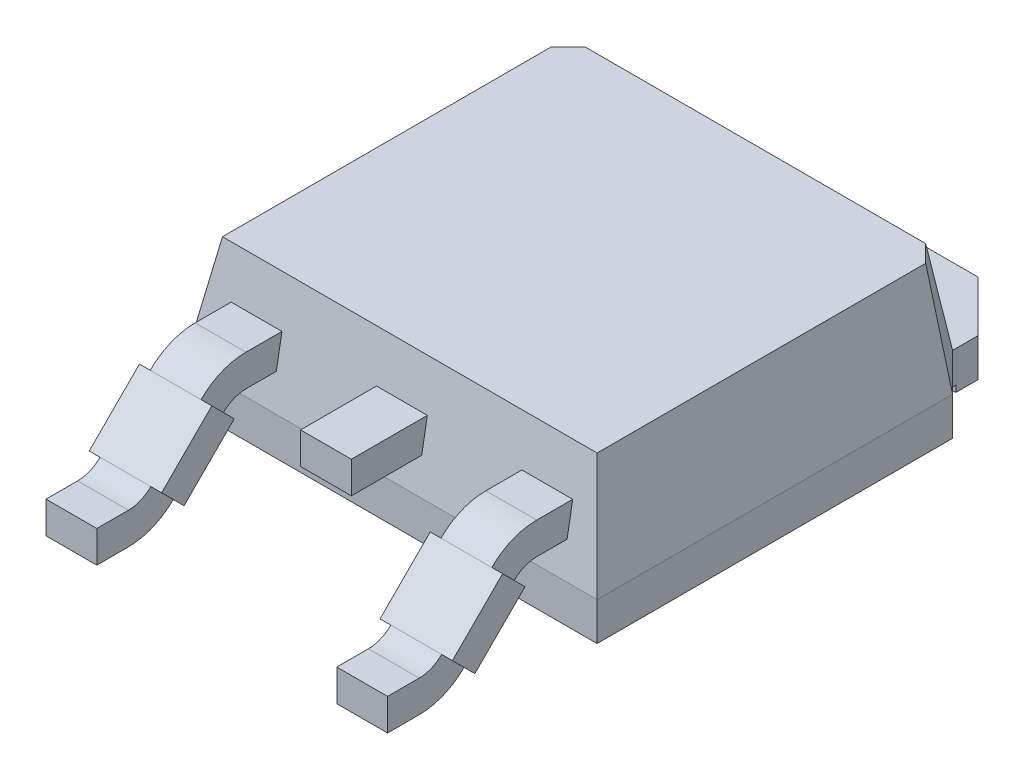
ISO-10303-21;
HEADER;
FILE_DESCRIPTION(('STEP AP214'),'2;1');
FILE_NAME('part.step','',(''),(''),'','','');
FILE_SCHEMA(('AUTOMOTIVE_DESIGN { 1 0 10303 214 1 1 1 1 }'));
ENDSEC;
DATA;
#1=APPLICATION_CONTEXT('core data for automotive mechanical design processes');
#2=APPLICATION_PROTOCOL_DEFINITION('international standard','automotive_design',2000,#1);
#3=PRODUCT_CONTEXT('',#1,'mechanical');
#4=PRODUCT('Part','Part','',(#3));
#5=PRODUCT_RELATED_PRODUCT_CATEGORY('part','',(#4));
#6=PRODUCT_DEFINITION_FORMATION('','',#4);
#7=PRODUCT_DEFINITION_CONTEXT('part definition',#1,'design');
#8=PRODUCT_DEFINITION('design','',#6,#7);
#9=PRODUCT_DEFINITION_SHAPE('','',#8);
#10=(LENGTH_UNIT() NAMED_UNIT(*) SI_UNIT(.MILLI.,.METRE.));
#11=(NAMED_UNIT(*) PLANE_ANGLE_UNIT() SI_UNIT($,.RADIAN.));
#12=(NAMED_UNIT(*) SI_UNIT($,.STERADIAN.) SOLID_ANGLE_UNIT());
#13=UNCERTAINTY_MEASURE_WITH_UNIT(LENGTH_MEASURE(1.E-05),#10,'distance_accuracy_value','');
#14=(GEOMETRIC_REPRESENTATION_CONTEXT(3) GLOBAL_UNCERTAINTY_ASSIGNED_CONTEXT((#13)) GLOBAL_UNIT_ASSIGNED_CONTEXT((#10,
#11,#12)) REPRESENTATION_CONTEXT('',''));
#15=CARTESIAN_POINT('',(0.,0.,0.));
#16=DIRECTION('',(0.,0.,1.));
#17=DIRECTION('',(1.,0.,0.));
#18=AXIS2_PLACEMENT_3D('',#15,#16,#17);
#19=CARTESIAN_POINT('',(-3.25000000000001,2.43,-0.299755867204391));
#20=DIRECTION('',(0.,-0.173648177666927,-0.984807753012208));
#21=DIRECTION('',(0.,0.984807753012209,-0.173648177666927));
#22=AXIS2_PLACEMENT_3D('',#19,#20,#21);
#23=PLANE('',#22);
#24=DIRECTION('',(-0.171087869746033,0.970287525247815,-0.171087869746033));
#25=VECTOR('',#24,1.);
#26=CARTESIAN_POINT('',(2.76875641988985,3.45926796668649,-0.481243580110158));
#27=LINE('',#26,#25);
#28=CARTESIAN_POINT('',(3.25000000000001,0.729999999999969,0.));
#29=VERTEX_POINT('',#28);
#30=CARTESIAN_POINT('',(2.95024413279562,2.43,-0.299755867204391));
#31=VERTEX_POINT('',#30);
#32=EDGE_CURVE('E675',#29,#31,#27,.T.);
#33=ORIENTED_EDGE('',*,*,#32,.T.);
#34=DIRECTION('',(1.,0.,0.));
#35=VECTOR('',#34,1.);
#36=CARTESIAN_POINT('',(-3.25000000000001,2.43,-0.299755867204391));
#37=LINE('',#36,#35);
#38=CARTESIAN_POINT('',(-2.95024413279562,2.43,-0.299755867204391));
#39=VERTEX_POINT('',#38);
#40=EDGE_CURVE('E810',#39,#31,#37,.T.);
#41=ORIENTED_EDGE('',*,*,#40,.F.);
#42=DIRECTION('',(-0.171087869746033,-0.970287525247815,0.171087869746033));
#43=VECTOR('',#42,1.);
#44=CARTESIAN_POINT('',(-2.95901830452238,2.3802391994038,-0.290981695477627));
#45=LINE('',#44,#43);
#46=CARTESIAN_POINT('',(-3.25000000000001,0.729999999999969,0.));
#47=VERTEX_POINT('',#46);
#48=EDGE_CURVE('E672',#47,#39,#45,.F.);
#49=ORIENTED_EDGE('',*,*,#48,.F.);
#50=DIRECTION('',(-1.,0.,0.));
#51=VECTOR('',#50,1.);
#52=CARTESIAN_POINT('',(-3.25000000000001,0.729999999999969,0.));
#53=LINE('',#52,#51);
#54=EDGE_CURVE('E834',#29,#47,#53,.T.);
#55=ORIENTED_EDGE('',*,*,#54,.F.);
#56=EDGE_LOOP('',(#33,#41,#49,#55));
#57=FACE_BOUND('',#56,.T.);
#58=DIRECTION('',(0.,-0.984807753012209,0.173648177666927));
#59=VECTOR('',#58,1.);
#60=CARTESIAN_POINT('',(-1.89,2.43,-0.299755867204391));
#61=LINE('',#60,#59);
#62=CARTESIAN_POINT('',(-1.89,1.23,-0.0881634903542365));
#63=VERTEX_POINT('',#62);
#64=CARTESIAN_POINT('',(-1.89,1.73,-0.176326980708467));
#65=VERTEX_POINT('',#64);
#66=EDGE_CURVE('E856',#63,#65,#61,.F.);
#67=ORIENTED_EDGE('',*,*,#66,.F.);
#68=DIRECTION('',(1.,0.,0.));
#69=VECTOR('',#68,1.);
#70=CARTESIAN_POINT('',(-3.25000000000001,1.23,-0.0881634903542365));
#71=LINE('',#70,#69);
#72=CARTESIAN_POINT('',(-2.69,1.23,-0.0881634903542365));
#73=VERTEX_POINT('',#72);
#74=EDGE_CURVE('E850',#63,#73,#71,.F.);
#75=ORIENTED_EDGE('',*,*,#74,.T.);
#76=DIRECTION('',(0.,-0.984807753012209,0.173648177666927));
#77=VECTOR('',#76,1.);
#78=CARTESIAN_POINT('',(-2.69,2.43,-0.299755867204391));
#79=LINE('',#78,#77);
#80=CARTESIAN_POINT('',(-2.69,1.73,-0.176326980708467));
#81=VERTEX_POINT('',#80);
#82=EDGE_CURVE('E845',#73,#81,#79,.F.);
#83=ORIENTED_EDGE('',*,*,#82,.T.);
#84=DIRECTION('',(-1.,0.,0.));
#85=VECTOR('',#84,1.);
#86=CARTESIAN_POINT('',(-3.25000000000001,1.73,-0.176326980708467));
#87=LINE('',#86,#85);
#88=EDGE_CURVE('E853',#81,#65,#87,.F.);
#89=ORIENTED_EDGE('',*,*,#88,.T.);
#90=EDGE_LOOP('',(#67,#75,#83,#89));
#91=FACE_BOUND('',#90,.T.);
#92=DIRECTION('',(0.,0.984807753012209,-0.173648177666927));
#93=VECTOR('',#92,1.);
#94=CARTESIAN_POINT('',(1.89,2.43,-0.299755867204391));
#95=LINE('',#94,#93);
#96=CARTESIAN_POINT('',(1.89,1.73,-0.176326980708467));
#97=VERTEX_POINT('',#96);
#98=CARTESIAN_POINT('',(1.89,1.23,-0.0881634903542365));
#99=VERTEX_POINT('',#98);
#100=EDGE_CURVE('E871',#97,#99,#95,.F.);
#101=ORIENTED_EDGE('',*,*,#100,.F.);
#102=DIRECTION('',(1.,0.,0.));
#103=VECTOR('',#102,1.);
#104=CARTESIAN_POINT('',(-3.25000000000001,1.73,-0.176326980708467));
#105=LINE('',#104,#103);
#106=CARTESIAN_POINT('',(2.69,1.73,-0.176326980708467));
#107=VERTEX_POINT('',#106);
#108=EDGE_CURVE('E867',#107,#97,#105,.F.);
#109=ORIENTED_EDGE('',*,*,#108,.F.);
#110=DIRECTION('',(0.,0.984807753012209,-0.173648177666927));
#111=VECTOR('',#110,1.);
#112=CARTESIAN_POINT('',(2.69,2.43,-0.299755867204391));
#113=LINE('',#112,#111);
#114=CARTESIAN_POINT('',(2.69,1.23,-0.0881634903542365));
#115=VERTEX_POINT('',#114);
#116=EDGE_CURVE('E864',#107,#115,#113,.F.);
#117=ORIENTED_EDGE('',*,*,#116,.T.);
#118=DIRECTION('',(-1.,0.,0.));
#119=VECTOR('',#118,1.);
#120=CARTESIAN_POINT('',(-3.25000000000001,1.23,-0.0881634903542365));
#121=LINE('',#120,#119);
#122=EDGE_CURVE('E869',#99,#115,#121,.F.);
#123=ORIENTED_EDGE('',*,*,#122,.F.);
#124=EDGE_LOOP('',(#101,#109,#117,#123));
#125=FACE_BOUND('',#124,.T.);
#126=DIRECTION('',(1.,0.,0.));
#127=VECTOR('',#126,1.);
#128=CARTESIAN_POINT('',(-3.25000000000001,1.23,-0.0881634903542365));
#129=LINE('',#128,#127);
#130=CARTESIAN_POINT('',(0.4,1.23,-0.0881634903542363));
#131=VERTEX_POINT('',#130);
#132=CARTESIAN_POINT('',(-0.4,1.23,-0.0881634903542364));
#133=VERTEX_POINT('',#132);
#134=EDGE_CURVE('E41',#131,#133,#129,.F.);
#135=ORIENTED_EDGE('',*,*,#134,.T.);
#136=DIRECTION('',(0.,-0.984807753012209,0.173648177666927));
#137=VECTOR('',#136,1.);
#138=CARTESIAN_POINT('',(-0.4,2.43,-0.299755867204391));
#139=LINE('',#138,#137);
#140=CARTESIAN_POINT('',(-0.4,1.73,-0.176326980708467));
#141=VERTEX_POINT('',#140);
#142=EDGE_CURVE('E12',#133,#141,#139,.F.);
#143=ORIENTED_EDGE('',*,*,#142,.T.);
#144=DIRECTION('',(-1.,0.,0.));
#145=VECTOR('',#144,1.);
#146=CARTESIAN_POINT('',(-3.25000000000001,1.73,-0.176326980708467));
#147=LINE('',#146,#145);
#148=CARTESIAN_POINT('',(0.4,1.73,-0.176326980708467));
#149=VERTEX_POINT('',#148);
#150=EDGE_CURVE('E879',#141,#149,#147,.F.);
#151=ORIENTED_EDGE('',*,*,#150,.T.);
#152=DIRECTION('',(0.,0.984807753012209,-0.173648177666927));
#153=VECTOR('',#152,1.);
#154=CARTESIAN_POINT('',(0.4,2.43,-0.299755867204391));
#155=LINE('',#154,#153);
#156=EDGE_CURVE('E882',#149,#131,#155,.F.);
#157=ORIENTED_EDGE('',*,*,#156,.T.);
#158=EDGE_LOOP('',(#135,#143,#151,#157));
#159=FACE_BOUND('',#158,.T.);
#160=ADVANCED_FACE('F33',(#57,#91,#125,#159),#23,.F.);
#161=CARTESIAN_POINT('',(1.89,0.73,0.391116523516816));
#162=DIRECTION('',(-1.,0.,0.));
#163=DIRECTION('',(0.,0.,-1.));
#164=AXIS2_PLACEMENT_3D('',#161,#162,#163);
#165=PLANE('',#164);
#166=DIRECTION('',(0.,0.707106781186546,0.707106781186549));
#167=VECTOR('',#166,1.);
#168=CARTESIAN_POINT('',(1.89,-0.0606601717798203,1.18177669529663));
#169=LINE('',#168,#167);
#170=CARTESIAN_POINT('',(1.89,0.292893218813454,1.53533008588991));
#171=VERTEX_POINT('',#170);
#172=CARTESIAN_POINT('',(1.89,0.646446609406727,1.88888347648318));
#173=VERTEX_POINT('',#172);
#174=EDGE_CURVE('E480',#171,#173,#169,.T.);
#175=ORIENTED_EDGE('',*,*,#174,.F.);
#176=CARTESIAN_POINT('',(1.89,1.,2.24243686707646));
#177=DIRECTION('',(1.,0.,0.));
#178=DIRECTION('',(0.,0.,1.));
#179=AXIS2_PLACEMENT_3D('',#176,#177,#178);
#180=CIRCLE('',#179,1.);
#181=CARTESIAN_POINT('',(1.89,0.,2.24243686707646));
#182=VERTEX_POINT('',#181);
#183=EDGE_CURVE('E512',#182,#171,#180,.T.);
#184=ORIENTED_EDGE('',*,*,#183,.F.);
#185=DIRECTION('',(0.,0.,-1.));
#186=VECTOR('',#185,1.);
#187=CARTESIAN_POINT('',(1.89,0.,2.24243686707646));
#188=LINE('',#187,#186);
#189=CARTESIAN_POINT('',(1.89,0.,2.74));
#190=VERTEX_POINT('',#189);
#191=EDGE_CURVE('E515',#190,#182,#188,.T.);
#192=ORIENTED_EDGE('',*,*,#191,.F.);
#193=DIRECTION('',(0.,-1.,0.));
#194=VECTOR('',#193,1.);
#195=CARTESIAN_POINT('',(1.89,0.,2.74));
#196=LINE('',#195,#194);
#197=CARTESIAN_POINT('',(1.89,0.5,2.74));
#198=VERTEX_POINT('',#197);
#199=EDGE_CURVE('E518',#198,#190,#196,.T.);
#200=ORIENTED_EDGE('',*,*,#199,.F.);
#201=DIRECTION('',(0.,0.,1.));
#202=VECTOR('',#201,1.);
#203=CARTESIAN_POINT('',(1.89,0.5,2.24243686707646));
#204=LINE('',#203,#202);
#205=CARTESIAN_POINT('',(1.89,0.5,2.24243686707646));
#206=VERTEX_POINT('',#205);
#207=EDGE_CURVE('E521',#206,#198,#204,.T.);
#208=ORIENTED_EDGE('',*,*,#207,.F.);
#209=CARTESIAN_POINT('',(1.89,1.,2.24243686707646));
#210=DIRECTION('',(-1.,0.,0.));
#211=DIRECTION('',(0.,0.,1.));
#212=AXIS2_PLACEMENT_3D('',#209,#210,#211);
#213=CIRCLE('',#212,0.5);
#214=EDGE_CURVE('E524',#173,#206,#213,.T.);
#215=ORIENTED_EDGE('',*,*,#214,.F.);
#216=EDGE_LOOP('',(#175,#184,#192,#200,#208,#215));
#217=FACE_BOUND('',#216,.T.);
#218=ADVANCED_FACE('F901',(#217),#165,.T.);
#219=CARTESIAN_POINT('',(2.69,0.73,0.391116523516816));
#220=DIRECTION('',(-1.,0.,0.));
#221=DIRECTION('',(0.,0.,-1.));
#222=AXIS2_PLACEMENT_3D('',#219,#220,#221);
#223=PLANE('',#222);
#224=CARTESIAN_POINT('',(2.69,1.,2.24243686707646));
#225=DIRECTION('',(1.,0.,0.));
#226=DIRECTION('',(0.,0.,1.));
#227=AXIS2_PLACEMENT_3D('',#224,#225,#226);
#228=CIRCLE('',#227,1.);
#229=CARTESIAN_POINT('',(2.69,0.,2.24243686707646));
#230=VERTEX_POINT('',#229);
#231=CARTESIAN_POINT('',(2.69,0.292893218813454,1.53533008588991));
#232=VERTEX_POINT('',#231);
#233=EDGE_CURVE('E486',#230,#232,#228,.T.);
#234=ORIENTED_EDGE('',*,*,#233,.T.);
#235=DIRECTION('',(0.,0.707106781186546,0.707106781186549));
#236=VECTOR('',#235,1.);
#237=CARTESIAN_POINT('',(2.69,-0.0606601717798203,1.18177669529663));
#238=LINE('',#237,#236);
#239=CARTESIAN_POINT('',(2.69,0.646446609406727,1.88888347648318));
#240=VERTEX_POINT('',#239);
#241=EDGE_CURVE('E876',#232,#240,#238,.T.);
#242=ORIENTED_EDGE('',*,*,#241,.T.);
#243=CARTESIAN_POINT('',(2.69,1.,2.24243686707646));
#244=DIRECTION('',(-1.,0.,0.));
#245=DIRECTION('',(0.,0.,1.));
#246=AXIS2_PLACEMENT_3D('',#243,#244,#245);
#247=CIRCLE('',#246,0.5);
#248=CARTESIAN_POINT('',(2.69,0.5,2.24243686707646));
#249=VERTEX_POINT('',#248);
#250=EDGE_CURVE('E498',#240,#249,#247,.T.);
#251=ORIENTED_EDGE('',*,*,#250,.T.);
#252=DIRECTION('',(0.,0.,1.));
#253=VECTOR('',#252,1.);
#254=CARTESIAN_POINT('',(2.69,0.5,2.24243686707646));
#255=LINE('',#254,#253);
#256=CARTESIAN_POINT('',(2.69,0.5,2.74));
#257=VERTEX_POINT('',#256);
#258=EDGE_CURVE('E495',#249,#257,#255,.T.);
#259=ORIENTED_EDGE('',*,*,#258,.T.);
#260=DIRECTION('',(0.,-1.,0.));
#261=VECTOR('',#260,1.);
#262=CARTESIAN_POINT('',(2.69,0.,2.74));
#263=LINE('',#262,#261);
#264=CARTESIAN_POINT('',(2.69,0.,2.74));
#265=VERTEX_POINT('',#264);
#266=EDGE_CURVE('E492',#257,#265,#263,.T.);
#267=ORIENTED_EDGE('',*,*,#266,.T.);
#268=DIRECTION('',(0.,0.,-1.));
#269=VECTOR('',#268,1.);
#270=CARTESIAN_POINT('',(2.69,0.,2.24243686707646));
#271=LINE('',#270,#269);
#272=EDGE_CURVE('E489',#265,#230,#271,.T.);
#273=ORIENTED_EDGE('',*,*,#272,.T.);
#274=EDGE_LOOP('',(#234,#242,#251,#259,#267,#273));
#275=FACE_BOUND('',#274,.T.);
#276=ADVANCED_FACE('F907',(#275),#223,.F.);
#277=CARTESIAN_POINT('',(-1.89,0.73,0.391116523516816));
#278=DIRECTION('',(1.,0.,0.));
#279=DIRECTION('',(0.,0.,-1.));
#280=AXIS2_PLACEMENT_3D('',#277,#278,#279);
#281=PLANE('',#280);
#282=CARTESIAN_POINT('',(-1.89,0.73,0.391116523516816));
#283=DIRECTION('',(1.,0.,0.));
#284=DIRECTION('',(0.,0.,-1.));
#285=AXIS2_PLACEMENT_3D('',#282,#283,#284);
#286=CIRCLE('',#285,1.);
#287=CARTESIAN_POINT('',(-1.89,1.73,0.391116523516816));
#288=VERTEX_POINT('',#287);
#289=CARTESIAN_POINT('',(-1.89,1.43710678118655,1.09822330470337));
#290=VERTEX_POINT('',#289);
#291=EDGE_CURVE('E621',#288,#290,#286,.T.);
#292=ORIENTED_EDGE('',*,*,#291,.T.);
#293=DIRECTION('',(0.,-0.707106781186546,-0.707106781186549));
#294=VECTOR('',#293,1.);
#295=CARTESIAN_POINT('',(-1.89,0.73,0.391116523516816));
#296=LINE('',#295,#294);
#297=CARTESIAN_POINT('',(-1.89,1.08355339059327,0.744669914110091));
#298=VERTEX_POINT('',#297);
#299=EDGE_CURVE('E595',#290,#298,#296,.T.);
#300=ORIENTED_EDGE('',*,*,#299,.T.);
#301=CARTESIAN_POINT('',(-1.89,0.73,0.391116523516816));
#302=DIRECTION('',(-1.,0.,0.));
#303=DIRECTION('',(0.,0.,-1.));
#304=AXIS2_PLACEMENT_3D('',#301,#302,#303);
#305=CIRCLE('',#304,0.500000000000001);
#306=CARTESIAN_POINT('',(-1.89,1.23,0.391116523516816));
#307=VERTEX_POINT('',#306);
#308=EDGE_CURVE('E635',#298,#307,#305,.T.);
#309=ORIENTED_EDGE('',*,*,#308,.T.);
#310=DIRECTION('',(0.,0.,-1.));
#311=VECTOR('',#310,1.);
#312=CARTESIAN_POINT('',(-1.89,1.23,-0.5));
#313=LINE('',#312,#311);
#314=EDGE_CURVE('E637',#307,#63,#313,.T.);
#315=ORIENTED_EDGE('',*,*,#314,.T.);
#316=ORIENTED_EDGE('',*,*,#66,.T.);
#317=DIRECTION('',(0.,0.,1.));
#318=VECTOR('',#317,1.);
#319=CARTESIAN_POINT('',(-1.89,1.73,-0.5));
#320=LINE('',#319,#318);
#321=EDGE_CURVE('E619',#65,#288,#320,.T.);
#322=ORIENTED_EDGE('',*,*,#321,.T.);
#323=EDGE_LOOP('',(#292,#300,#309,#315,#316,#322));
#324=FACE_BOUND('',#323,.T.);
#325=ADVANCED_FACE('F1142',(#324),#281,.T.);
#326=CARTESIAN_POINT('',(-1.89,1.,2.24243686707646));
#327=DIRECTION('',(1.,0.,0.));
#328=DIRECTION('',(0.,0.,1.));
#329=AXIS2_PLACEMENT_3D('',#326,#327,#328);
#330=CIRCLE('',#329,1.);
#331=CARTESIAN_POINT('',(-1.89,0.,2.24243686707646));
#332=VERTEX_POINT('',#331);
#333=CARTESIAN_POINT('',(-1.89,0.292893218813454,1.53533008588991));
#334=VERTEX_POINT('',#333);
#335=EDGE_CURVE('E632',#332,#334,#330,.T.);
#336=ORIENTED_EDGE('',*,*,#335,.T.);
#337=DIRECTION('',(0.,0.707106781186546,0.707106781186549));
#338=VECTOR('',#337,1.);
#339=CARTESIAN_POINT('',(-1.89,-0.0606601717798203,1.18177669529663));
#340=LINE('',#339,#338);
#341=CARTESIAN_POINT('',(-1.89,0.646446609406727,1.88888347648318));
#342=VERTEX_POINT('',#341);
#343=EDGE_CURVE('E592',#334,#342,#340,.T.);
#344=ORIENTED_EDGE('',*,*,#343,.T.);
#345=CARTESIAN_POINT('',(-1.89,1.,2.24243686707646));
#346=DIRECTION('',(-1.,0.,0.));
#347=DIRECTION('',(0.,0.,1.));
#348=AXIS2_PLACEMENT_3D('',#345,#346,#347);
#349=CIRCLE('',#348,0.5);
#350=CARTESIAN_POINT('',(-1.89,0.5,2.24243686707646));
#351=VERTEX_POINT('',#350);
#352=EDGE_CURVE('E624',#342,#351,#349,.T.);
#353=ORIENTED_EDGE('',*,*,#352,.T.);
#354=DIRECTION('',(0.,0.,1.));
#355=VECTOR('',#354,1.);
#356=CARTESIAN_POINT('',(-1.89,0.5,2.24243686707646));
#357=LINE('',#356,#355);
#358=CARTESIAN_POINT('',(-1.89,0.5,2.74));
#359=VERTEX_POINT('',#358);
#360=EDGE_CURVE('E626',#351,#359,#357,.T.);
#361=ORIENTED_EDGE('',*,*,#360,.T.);
#362=DIRECTION('',(0.,-1.,0.));
#363=VECTOR('',#362,1.);
#364=CARTESIAN_POINT('',(-1.89,0.,2.74));
#365=LINE('',#364,#363);
#366=CARTESIAN_POINT('',(-1.89,0.,2.74));
#367=VERTEX_POINT('',#366);
#368=EDGE_CURVE('E628',#359,#367,#365,.T.);
#369=ORIENTED_EDGE('',*,*,#368,.T.);
#370=DIRECTION('',(0.,0.,-1.));
#371=VECTOR('',#370,1.);
#372=CARTESIAN_POINT('',(-1.89,0.,2.24243686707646));
#373=LINE('',#372,#371);
#374=EDGE_CURVE('E630',#367,#332,#373,.T.);
#375=ORIENTED_EDGE('',*,*,#374,.T.);
#376=EDGE_LOOP('',(#336,#344,#353,#361,#369,#375));
#377=FACE_BOUND('',#376,.T.);
#378=ADVANCED_FACE('F1136',(#377),#281,.T.);
#379=CARTESIAN_POINT('',(-2.69,0.73,0.391116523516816));
#380=DIRECTION('',(1.,0.,0.));
#381=DIRECTION('',(0.,0.,-1.));
#382=AXIS2_PLACEMENT_3D('',#379,#380,#381);
#383=PLANE('',#382);
#384=DIRECTION('',(0.,-0.707106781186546,-0.707106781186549));
#385=VECTOR('',#384,1.);
#386=CARTESIAN_POINT('',(-2.69,0.73,0.391116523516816));
#387=LINE('',#386,#385);
#388=CARTESIAN_POINT('',(-2.69,1.43710678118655,1.09822330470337));
#389=VERTEX_POINT('',#388);
#390=CARTESIAN_POINT('',(-2.69,1.08355339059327,0.744669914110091));
#391=VERTEX_POINT('',#390);
#392=EDGE_CURVE('E861',#389,#391,#387,.T.);
#393=ORIENTED_EDGE('',*,*,#392,.F.);
#394=CARTESIAN_POINT('',(-2.69,0.73,0.391116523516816));
#395=DIRECTION('',(1.,0.,0.));
#396=DIRECTION('',(0.,0.,-1.));
#397=AXIS2_PLACEMENT_3D('',#394,#395,#396);
#398=CIRCLE('',#397,1.);
#399=CARTESIAN_POINT('',(-2.69,1.73,0.391116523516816));
#400=VERTEX_POINT('',#399);
#401=EDGE_CURVE('E600',#400,#389,#398,.T.);
#402=ORIENTED_EDGE('',*,*,#401,.F.);
#403=DIRECTION('',(0.,0.,1.));
#404=VECTOR('',#403,1.);
#405=CARTESIAN_POINT('',(-2.69,1.73,-0.5));
#406=LINE('',#405,#404);
#407=EDGE_CURVE('E598',#81,#400,#406,.T.);
#408=ORIENTED_EDGE('',*,*,#407,.F.);
#409=ORIENTED_EDGE('',*,*,#82,.F.);
#410=DIRECTION('',(0.,0.,-1.));
#411=VECTOR('',#410,1.);
#412=CARTESIAN_POINT('',(-2.69,1.23,-0.5));
#413=LINE('',#412,#411);
#414=CARTESIAN_POINT('',(-2.69,1.23,0.391116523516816));
#415=VERTEX_POINT('',#414);
#416=EDGE_CURVE('E616',#415,#73,#413,.T.);
#417=ORIENTED_EDGE('',*,*,#416,.F.);
#418=CARTESIAN_POINT('',(-2.69,0.73,0.391116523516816));
#419=DIRECTION('',(-1.,0.,0.));
#420=DIRECTION('',(0.,0.,-1.));
#421=AXIS2_PLACEMENT_3D('',#418,#419,#420);
#422=CIRCLE('',#421,0.500000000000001);
#423=EDGE_CURVE('E614',#391,#415,#422,.T.);
#424=ORIENTED_EDGE('',*,*,#423,.F.);
#425=EDGE_LOOP('',(#393,#402,#408,#409,#417,#424));
#426=FACE_BOUND('',#425,.T.);
#427=ADVANCED_FACE('F1130',(#426),#383,.F.);
#428=DIRECTION('',(0.,0.707106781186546,0.707106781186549));
#429=VECTOR('',#428,1.);
#430=CARTESIAN_POINT('',(-2.69,-0.0606601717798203,1.18177669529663));
#431=LINE('',#430,#429);
#432=CARTESIAN_POINT('',(-2.69,0.292893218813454,1.53533008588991));
#433=VERTEX_POINT('',#432);
#434=CARTESIAN_POINT('',(-2.69,0.646446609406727,1.88888347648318));
#435=VERTEX_POINT('',#434);
#436=EDGE_CURVE('E858',#433,#435,#431,.T.);
#437=ORIENTED_EDGE('',*,*,#436,.F.);
#438=CARTESIAN_POINT('',(-2.69,1.,2.24243686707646));
#439=DIRECTION('',(1.,0.,0.));
#440=DIRECTION('',(0.,0.,1.));
#441=AXIS2_PLACEMENT_3D('',#438,#439,#440);
#442=CIRCLE('',#441,1.);
#443=CARTESIAN_POINT('',(-2.69,0.,2.24243686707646));
#444=VERTEX_POINT('',#443);
#445=EDGE_CURVE('E611',#444,#433,#442,.T.);
#446=ORIENTED_EDGE('',*,*,#445,.F.);
#447=DIRECTION('',(0.,0.,-1.));
#448=VECTOR('',#447,1.);
#449=CARTESIAN_POINT('',(-2.69,0.,2.24243686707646));
#450=LINE('',#449,#448);
#451=CARTESIAN_POINT('',(-2.69,0.,2.74));
#452=VERTEX_POINT('',#451);
#453=EDGE_CURVE('E609',#452,#444,#450,.T.);
#454=ORIENTED_EDGE('',*,*,#453,.F.);
#455=DIRECTION('',(0.,-1.,0.));
#456=VECTOR('',#455,1.);
#457=CARTESIAN_POINT('',(-2.69,0.,2.74));
#458=LINE('',#457,#456);
#459=CARTESIAN_POINT('',(-2.69,0.5,2.74));
#460=VERTEX_POINT('',#459);
#461=EDGE_CURVE('E607',#460,#452,#458,.T.);
#462=ORIENTED_EDGE('',*,*,#461,.F.);
#463=DIRECTION('',(0.,0.,1.));
#464=VECTOR('',#463,1.);
#465=CARTESIAN_POINT('',(-2.69,0.5,2.24243686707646));
#466=LINE('',#465,#464);
#467=CARTESIAN_POINT('',(-2.69,0.5,2.24243686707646));
#468=VERTEX_POINT('',#467);
#469=EDGE_CURVE('E605',#468,#460,#466,.T.);
#470=ORIENTED_EDGE('',*,*,#469,.F.);
#471=CARTESIAN_POINT('',(-2.69,1.,2.24243686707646));
#472=DIRECTION('',(-1.,0.,0.));
#473=DIRECTION('',(0.,0.,1.));
#474=AXIS2_PLACEMENT_3D('',#471,#472,#473);
#475=CIRCLE('',#474,0.5);
#476=EDGE_CURVE('E603',#435,#468,#475,.T.);
#477=ORIENTED_EDGE('',*,*,#476,.F.);
#478=EDGE_LOOP('',(#437,#446,#454,#462,#470,#477));
#479=FACE_BOUND('',#478,.T.);
#480=ADVANCED_FACE('F1126',(#479),#383,.F.);
#481=CARTESIAN_POINT('',(-3.25000000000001,0.13,0.));
#482=DIRECTION('',(0.,-1.,0.));
#483=DIRECTION('',(0.,0.,-1.));
#484=AXIS2_PLACEMENT_3D('',#481,#482,#483);
#485=PLANE('',#484);
#486=DIRECTION('',(0.,0.,-1.));
#487=VECTOR('',#486,1.);
#488=CARTESIAN_POINT('',(2.64999999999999,0.13,-6.2));
#489=LINE('',#488,#487);
#490=CARTESIAN_POINT('',(2.65000000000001,0.13,-6.25));
#491=VERTEX_POINT('',#490);
#492=CARTESIAN_POINT('',(2.65,0.13,-6.6));
#493=VERTEX_POINT('',#492);
#494=EDGE_CURVE('E770',#491,#493,#489,.T.);
#495=ORIENTED_EDGE('',*,*,#494,.F.);
#496=DIRECTION('',(1.,0.,0.));
#497=VECTOR('',#496,1.);
#498=CARTESIAN_POINT('',(2.65000000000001,0.13,-6.25));
#499=LINE('',#498,#497);
#500=CARTESIAN_POINT('',(2.45,0.13,-6.25));
#501=VERTEX_POINT('',#500);
#502=EDGE_CURVE('E695',#491,#501,#499,.F.);
#503=ORIENTED_EDGE('',*,*,#502,.T.);
#504=DIRECTION('',(0.,0.,1.));
#505=VECTOR('',#504,1.);
#506=CARTESIAN_POINT('',(2.45,0.13,-6.2));
#507=LINE('',#506,#505);
#508=CARTESIAN_POINT('',(2.45,0.13,-2.24));
#509=VERTEX_POINT('',#508);
#510=EDGE_CURVE('E692',#501,#509,#507,.T.);
#511=ORIENTED_EDGE('',*,*,#510,.T.);
#512=DIRECTION('',(1.,0.,0.));
#513=VECTOR('',#512,1.);
#514=CARTESIAN_POINT('',(-2.5,0.13,-2.24));
#515=LINE('',#514,#513);
#516=CARTESIAN_POINT('',(-2.45,0.13,-2.24));
#517=VERTEX_POINT('',#516);
#518=EDGE_CURVE('E689',#509,#517,#515,.F.);
#519=ORIENTED_EDGE('',*,*,#518,.T.);
#520=DIRECTION('',(0.,0.,1.));
#521=VECTOR('',#520,1.);
#522=CARTESIAN_POINT('',(-2.45,0.13,-6.2));
#523=LINE('',#522,#521);
#524=CARTESIAN_POINT('',(-2.45,0.13,-6.25));
#525=VERTEX_POINT('',#524);
#526=EDGE_CURVE('E686',#517,#525,#523,.F.);
#527=ORIENTED_EDGE('',*,*,#526,.T.);
#528=DIRECTION('',(1.,0.,0.));
#529=VECTOR('',#528,1.);
#530=CARTESIAN_POINT('',(-2.65000000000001,0.13,-6.25));
#531=LINE('',#530,#529);
#532=CARTESIAN_POINT('',(-2.65000000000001,0.13,-6.25));
#533=VERTEX_POINT('',#532);
#534=EDGE_CURVE('E683',#525,#533,#531,.F.);
#535=ORIENTED_EDGE('',*,*,#534,.T.);
#536=DIRECTION('',(0.,0.,1.));
#537=VECTOR('',#536,1.);
#538=CARTESIAN_POINT('',(-2.65000000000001,0.13,-6.2));
#539=LINE('',#538,#537);
#540=CARTESIAN_POINT('',(-2.65000000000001,0.13,-6.6));
#541=VERTEX_POINT('',#540);
#542=EDGE_CURVE('E744',#541,#533,#539,.T.);
#543=ORIENTED_EDGE('',*,*,#542,.F.);
#544=DIRECTION('',(-0.707106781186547,0.,0.707106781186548));
#545=VECTOR('',#544,1.);
#546=CARTESIAN_POINT('',(-2.65000000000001,0.13,-6.6));
#547=LINE('',#546,#545);
#548=CARTESIAN_POINT('',(-1.85000000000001,0.13,-7.4));
#549=VERTEX_POINT('',#548);
#550=EDGE_CURVE('E776',#549,#541,#547,.T.);
#551=ORIENTED_EDGE('',*,*,#550,.F.);
#552=DIRECTION('',(-1.,0.,0.));
#553=VECTOR('',#552,1.);
#554=CARTESIAN_POINT('',(-1.85000000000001,0.13,-7.4));
#555=LINE('',#554,#553);
#556=CARTESIAN_POINT('',(1.85,0.13,-7.4));
#557=VERTEX_POINT('',#556);
#558=EDGE_CURVE('E774',#557,#549,#555,.T.);
#559=ORIENTED_EDGE('',*,*,#558,.F.);
#560=DIRECTION('',(-0.707106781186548,0.,-0.707106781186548));
#561=VECTOR('',#560,1.);
#562=CARTESIAN_POINT('',(1.85,0.13,-7.4));
#563=LINE('',#562,#561);
#564=EDGE_CURVE('E772',#493,#557,#563,.T.);
#565=ORIENTED_EDGE('',*,*,#564,.F.);
#566=EDGE_LOOP('',(#495,#503,#511,#519,#527,#535,#543,#551,#559,#565));
#567=FACE_BOUND('',#566,.T.);
#568=ADVANCED_FACE('F992',(#567),#485,.T.);
#569=CARTESIAN_POINT('',(-2.65000000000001,0.73,-6.2));
#570=DIRECTION('',(1.,0.,0.));
#571=DIRECTION('',(0.,0.,-1.));
#572=AXIS2_PLACEMENT_3D('',#569,#570,#571);
#573=PLANE('',#572);
#574=DIRECTION('',(0.,-1.,0.));
#575=VECTOR('',#574,1.);
#576=CARTESIAN_POINT('',(-2.65000000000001,0.23,-6.25));
#577=LINE('',#576,#575);
#578=CARTESIAN_POINT('',(-2.65000000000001,0.23,-6.25));
#579=VERTEX_POINT('',#578);
#580=EDGE_CURVE('E764',#579,#533,#577,.T.);
#581=ORIENTED_EDGE('',*,*,#580,.F.);
#582=DIRECTION('',(0.,0.,1.));
#583=VECTOR('',#582,1.);
#584=CARTESIAN_POINT('',(-2.65000000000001,0.23,-6.25));
#585=LINE('',#584,#583);
#586=CARTESIAN_POINT('',(-2.65000000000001,0.23,-6.2));
#587=VERTEX_POINT('',#586);
#588=EDGE_CURVE('E713',#579,#587,#585,.T.);
#589=ORIENTED_EDGE('',*,*,#588,.T.);
#590=DIRECTION('',(0.,-1.,0.));
#591=VECTOR('',#590,1.);
#592=CARTESIAN_POINT('',(-2.65000000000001,0.73,-6.2));
#593=LINE('',#592,#591);
#594=CARTESIAN_POINT('',(-2.65000000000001,0.73,-6.2));
#595=VERTEX_POINT('',#594);
#596=EDGE_CURVE('E794',#595,#587,#593,.T.);
#597=ORIENTED_EDGE('',*,*,#596,.F.);
#598=DIRECTION('',(0.,0.,1.));
#599=VECTOR('',#598,1.);
#600=CARTESIAN_POINT('',(-2.65000000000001,0.73,-6.2));
#601=LINE('',#600,#599);
#602=CARTESIAN_POINT('',(-2.65000000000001,0.73,-6.6));
#603=VERTEX_POINT('',#602);
#604=EDGE_CURVE('E778',#603,#595,#601,.T.);
#605=ORIENTED_EDGE('',*,*,#604,.F.);
#606=DIRECTION('',(0.,-1.,0.));
#607=VECTOR('',#606,1.);
#608=CARTESIAN_POINT('',(-2.65000000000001,0.73,-6.6));
#609=LINE('',#608,#607);
#610=EDGE_CURVE('E1079',#603,#541,#609,.T.);
#611=ORIENTED_EDGE('',*,*,#610,.T.);
#612=ORIENTED_EDGE('',*,*,#542,.T.);
#613=EDGE_LOOP('',(#581,#589,#597,#605,#611,#612));
#614=FACE_BOUND('',#613,.T.);
#615=ADVANCED_FACE('F988',(#614),#573,.F.);
#616=CARTESIAN_POINT('',(2.64999999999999,0.73,-6.2));
#617=DIRECTION('',(-1.,0.,0.));
#618=DIRECTION('',(0.,0.,1.));
#619=AXIS2_PLACEMENT_3D('',#616,#617,#618);
#620=PLANE('',#619);
#621=DIRECTION('',(0.,-1.,0.));
#622=VECTOR('',#621,1.);
#623=CARTESIAN_POINT('',(2.65000000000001,0.23,-6.25));
#624=LINE('',#623,#622);
#625=CARTESIAN_POINT('',(2.64999999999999,0.23,-6.25));
#626=VERTEX_POINT('',#625);
#627=EDGE_CURVE('E753',#626,#491,#624,.T.);
#628=ORIENTED_EDGE('',*,*,#627,.T.);
#629=ORIENTED_EDGE('',*,*,#494,.T.);
#630=DIRECTION('',(0.,-1.,0.));
#631=VECTOR('',#630,1.);
#632=CARTESIAN_POINT('',(2.65,0.73,-6.6));
#633=LINE('',#632,#631);
#634=CARTESIAN_POINT('',(2.65,0.73,-6.6));
#635=VERTEX_POINT('',#634);
#636=EDGE_CURVE('E795',#635,#493,#633,.T.);
#637=ORIENTED_EDGE('',*,*,#636,.F.);
#638=DIRECTION('',(0.,0.,-1.));
#639=VECTOR('',#638,1.);
#640=CARTESIAN_POINT('',(2.64999999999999,0.73,-6.2));
#641=LINE('',#640,#639);
#642=CARTESIAN_POINT('',(2.64999999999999,0.73,-6.2));
#643=VERTEX_POINT('',#642);
#644=EDGE_CURVE('E788',#643,#635,#641,.T.);
#645=ORIENTED_EDGE('',*,*,#644,.F.);
#646=DIRECTION('',(0.,-1.,0.));
#647=VECTOR('',#646,1.);
#648=CARTESIAN_POINT('',(2.64999999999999,0.73,-6.2));
#649=LINE('',#648,#647);
#650=CARTESIAN_POINT('',(2.65000000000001,0.23,-6.2));
#651=VERTEX_POINT('',#650);
#652=EDGE_CURVE('E791',#643,#651,#649,.T.);
#653=ORIENTED_EDGE('',*,*,#652,.T.);
#654=DIRECTION('',(0.,0.,-1.));
#655=VECTOR('',#654,1.);
#656=CARTESIAN_POINT('',(2.65000000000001,0.23,-6.2));
#657=LINE('',#656,#655);
#658=EDGE_CURVE('E726',#651,#626,#657,.T.);
#659=ORIENTED_EDGE('',*,*,#658,.T.);
#660=EDGE_LOOP('',(#628,#629,#637,#645,#653,#659));
#661=FACE_BOUND('',#660,.T.);
#662=ADVANCED_FACE('F985',(#661),#620,.F.);
#663=CARTESIAN_POINT('',(-3.25000000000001,2.43,0.));
#664=DIRECTION('',(1.,0.,0.));
#665=DIRECTION('',(0.,0.,-1.));
#666=AXIS2_PLACEMENT_3D('',#663,#664,#665);
#667=PLANE('',#666);
#668=DIRECTION('',(0.,-1.,0.));
#669=VECTOR('',#668,1.);
#670=CARTESIAN_POINT('',(-3.25000000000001,2.43,0.));
#671=LINE('',#670,#669);
#672=CARTESIAN_POINT('',(-3.25000000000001,0.13,0.));
#673=VERTEX_POINT('',#672);
#674=EDGE_CURVE('E789',#47,#673,#671,.T.);
#675=ORIENTED_EDGE('',*,*,#674,.F.);
#676=DIRECTION('',(0.,0.,-1.));
#677=VECTOR('',#676,1.);
#678=CARTESIAN_POINT('',(-3.25000000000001,0.729999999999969,0.));
#679=LINE('',#678,#677);
#680=CARTESIAN_POINT('',(-3.25000000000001,0.729999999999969,-5.6));
#681=VERTEX_POINT('',#680);
#682=EDGE_CURVE('E828',#47,#681,#679,.T.);
#683=ORIENTED_EDGE('',*,*,#682,.T.);
#684=DIRECTION('',(0.,-1.,0.));
#685=VECTOR('',#684,1.);
#686=CARTESIAN_POINT('',(-3.25000000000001,2.43,-5.6));
#687=LINE('',#686,#685);
#688=CARTESIAN_POINT('',(-3.25000000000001,0.13,-5.6));
#689=VERTEX_POINT('',#688);
#690=EDGE_CURVE('E1040',#681,#689,#687,.T.);
#691=ORIENTED_EDGE('',*,*,#690,.T.);
#692=DIRECTION('',(0.,0.,1.));
#693=VECTOR('',#692,1.);
#694=CARTESIAN_POINT('',(-3.25000000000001,0.13,0.));
#695=LINE('',#694,#693);
#696=EDGE_CURVE('E807',#689,#673,#695,.T.);
#697=ORIENTED_EDGE('',*,*,#696,.T.);
#698=EDGE_LOOP('',(#675,#683,#691,#697));
#699=FACE_BOUND('',#698,.T.);
#700=ADVANCED_FACE('F35',(#699),#667,.F.);
#701=CARTESIAN_POINT('',(-3.25000000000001,2.43,0.));
#702=DIRECTION('',(0.,0.,-1.));
#703=DIRECTION('',(-1.,0.,0.));
#704=AXIS2_PLACEMENT_3D('',#701,#702,#703);
#705=PLANE('',#704);
#706=DIRECTION('',(0.,-1.,0.));
#707=VECTOR('',#706,1.);
#708=CARTESIAN_POINT('',(3.25000000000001,2.43,0.));
#709=LINE('',#708,#707);
#710=CARTESIAN_POINT('',(3.25000000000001,0.13,0.));
#711=VERTEX_POINT('',#710);
#712=EDGE_CURVE('E1021',#29,#711,#709,.T.);
#713=ORIENTED_EDGE('',*,*,#712,.F.);
#714=ORIENTED_EDGE('',*,*,#54,.T.);
#715=ORIENTED_EDGE('',*,*,#674,.T.);
#716=DIRECTION('',(1.,0.,0.));
#717=VECTOR('',#716,1.);
#718=CARTESIAN_POINT('',(-3.25000000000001,0.13,0.));
#719=LINE('',#718,#717);
#720=EDGE_CURVE('E1026',#673,#711,#719,.T.);
#721=ORIENTED_EDGE('',*,*,#720,.T.);
#722=EDGE_LOOP('',(#713,#714,#715,#721));
#723=FACE_BOUND('',#722,.T.);
#724=ADVANCED_FACE('F1011',(#723),#705,.F.);
#725=CARTESIAN_POINT('',(3.25000000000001,2.43,0.));
#726=DIRECTION('',(-1.,0.,0.));
#727=DIRECTION('',(0.,0.,1.));
#728=AXIS2_PLACEMENT_3D('',#725,#726,#727);
#729=PLANE('',#728);
#730=DIRECTION('',(0.,-1.,0.));
#731=VECTOR('',#730,1.);
#732=CARTESIAN_POINT('',(3.24999999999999,2.43,-5.6));
#733=LINE('',#732,#731);
#734=CARTESIAN_POINT('',(3.24999999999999,0.729999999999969,-5.6));
#735=VERTEX_POINT('',#734);
#736=CARTESIAN_POINT('',(3.24999999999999,0.13,-5.6));
#737=VERTEX_POINT('',#736);
#738=EDGE_CURVE('E1029',#735,#737,#733,.T.);
#739=ORIENTED_EDGE('',*,*,#738,.F.);
#740=DIRECTION('',(0.,0.,1.));
#741=VECTOR('',#740,1.);
#742=CARTESIAN_POINT('',(3.25000000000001,0.729999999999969,0.));
#743=LINE('',#742,#741);
#744=EDGE_CURVE('E832',#735,#29,#743,.T.);
#745=ORIENTED_EDGE('',*,*,#744,.T.);
#746=ORIENTED_EDGE('',*,*,#712,.T.);
#747=DIRECTION('',(0.,0.,-1.));
#748=VECTOR('',#747,1.);
#749=CARTESIAN_POINT('',(3.25000000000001,0.13,0.));
#750=LINE('',#749,#748);
#751=EDGE_CURVE('E1061',#711,#737,#750,.T.);
#752=ORIENTED_EDGE('',*,*,#751,.T.);
#753=EDGE_LOOP('',(#739,#745,#746,#752));
#754=FACE_BOUND('',#753,.T.);
#755=ADVANCED_FACE('F1008',(#754),#729,.F.);
#756=CARTESIAN_POINT('',(2.64999999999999,2.43,-6.2));
#757=DIRECTION('',(-0.707106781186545,0.,0.70710678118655));
#758=DIRECTION('',(0.70710678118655,0.,0.707106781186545));
#759=AXIS2_PLACEMENT_3D('',#756,#757,#758);
#760=PLANE('',#759);
#761=ORIENTED_EDGE('',*,*,#652,.F.);
#762=DIRECTION('',(0.70710678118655,0.,0.707106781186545));
#763=VECTOR('',#762,1.);
#764=CARTESIAN_POINT('',(2.64999999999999,0.729999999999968,-6.2));
#765=LINE('',#764,#763);
#766=EDGE_CURVE('E824',#643,#735,#765,.T.);
#767=ORIENTED_EDGE('',*,*,#766,.T.);
#768=ORIENTED_EDGE('',*,*,#738,.T.);
#769=DIRECTION('',(-0.70710678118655,0.,-0.707106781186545));
#770=VECTOR('',#769,1.);
#771=CARTESIAN_POINT('',(2.64999999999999,0.13,-6.2));
#772=LINE('',#771,#770);
#773=CARTESIAN_POINT('',(2.65000000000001,0.13,-6.2));
#774=VERTEX_POINT('',#773);
#775=EDGE_CURVE('E1066',#737,#774,#772,.T.);
#776=ORIENTED_EDGE('',*,*,#775,.T.);
#777=DIRECTION('',(0.,-1.,0.));
#778=VECTOR('',#777,1.);
#779=CARTESIAN_POINT('',(2.65000000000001,0.23,-6.2));
#780=LINE('',#779,#778);
#781=EDGE_CURVE('E751',#651,#774,#780,.T.);
#782=ORIENTED_EDGE('',*,*,#781,.F.);
#783=EDGE_LOOP('',(#761,#767,#768,#776,#782));
#784=FACE_BOUND('',#783,.T.);
#785=ADVANCED_FACE('F1004',(#784),#760,.F.);
#786=CARTESIAN_POINT('',(-3.25000000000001,2.43,-5.6));
#787=DIRECTION('',(0.707106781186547,0.,0.707106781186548));
#788=DIRECTION('',(0.707106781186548,0.,-0.707106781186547));
#789=AXIS2_PLACEMENT_3D('',#786,#787,#788);
#790=PLANE('',#789);
#791=ORIENTED_EDGE('',*,*,#690,.F.);
#792=DIRECTION('',(0.707106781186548,0.,-0.707106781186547));
#793=VECTOR('',#792,1.);
#794=CARTESIAN_POINT('',(-3.25000000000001,0.72999999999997,-5.6));
#795=LINE('',#794,#793);
#796=EDGE_CURVE('E821',#681,#595,#795,.T.);
#797=ORIENTED_EDGE('',*,*,#796,.T.);
#798=ORIENTED_EDGE('',*,*,#596,.T.);
#799=DIRECTION('',(0.,-1.,0.));
#800=VECTOR('',#799,1.);
#801=CARTESIAN_POINT('',(-2.65000000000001,0.23,-6.2));
#802=LINE('',#801,#800);
#803=CARTESIAN_POINT('',(-2.65000000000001,0.13,-6.2));
#804=VERTEX_POINT('',#803);
#805=EDGE_CURVE('E741',#587,#804,#802,.T.);
#806=ORIENTED_EDGE('',*,*,#805,.T.);
#807=DIRECTION('',(-0.707106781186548,0.,0.707106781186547));
#808=VECTOR('',#807,1.);
#809=CARTESIAN_POINT('',(-3.25000000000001,0.13,-5.6));
#810=LINE('',#809,#808);
#811=EDGE_CURVE('E1044',#804,#689,#810,.T.);
#812=ORIENTED_EDGE('',*,*,#811,.T.);
#813=EDGE_LOOP('',(#791,#797,#798,#806,#812));
#814=FACE_BOUND('',#813,.T.);
#815=ADVANCED_FACE('F1000',(#814),#790,.F.);
#816=CARTESIAN_POINT('',(-3.25000000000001,2.43,0.));
#817=DIRECTION('',(0.,-1.,0.));
#818=DIRECTION('',(0.,0.,-1.));
#819=AXIS2_PLACEMENT_3D('',#816,#817,#818);
#820=PLANE('',#819);
#821=DIRECTION('',(-0.70710678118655,0.,-0.707106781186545));
#822=VECTOR('',#821,1.);
#823=CARTESIAN_POINT('',(2.5880405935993,2.43,-5.83804059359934));
#824=LINE('',#823,#822);
#825=CARTESIAN_POINT('',(2.9502441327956,2.43,-5.47583705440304));
#826=VERTEX_POINT('',#825);
#827=CARTESIAN_POINT('',(2.68159481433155,2.43,-5.74448637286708));
#828=VERTEX_POINT('',#827);
#829=EDGE_CURVE('E816',#826,#828,#824,.T.);
#830=ORIENTED_EDGE('',*,*,#829,.T.);
#831=DIRECTION('',(-1.,0.,0.));
#832=VECTOR('',#831,1.);
#833=CARTESIAN_POINT('',(-3.25000000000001,2.43,-5.74448637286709));
#834=LINE('',#833,#832);
#835=CARTESIAN_POINT('',(-2.68159481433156,2.43,-5.74448637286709));
#836=VERTEX_POINT('',#835);
#837=EDGE_CURVE('E836',#828,#836,#834,.T.);
#838=ORIENTED_EDGE('',*,*,#837,.T.);
#839=DIRECTION('',(-0.707106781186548,0.,0.707106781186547));
#840=VECTOR('',#839,1.);
#841=CARTESIAN_POINT('',(-5.83804059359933,2.43,-2.58804059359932));
#842=LINE('',#841,#840);
#843=CARTESIAN_POINT('',(-2.95024413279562,2.43,-5.47583705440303));
#844=VERTEX_POINT('',#843);
#845=EDGE_CURVE('E819',#836,#844,#842,.T.);
#846=ORIENTED_EDGE('',*,*,#845,.T.);
#847=DIRECTION('',(0.,0.,1.));
#848=VECTOR('',#847,1.);
#849=CARTESIAN_POINT('',(-2.95024413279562,2.43,0.));
#850=LINE('',#849,#848);
#851=EDGE_CURVE('E814',#844,#39,#850,.T.);
#852=ORIENTED_EDGE('',*,*,#851,.T.);
#853=ORIENTED_EDGE('',*,*,#40,.T.);
#854=DIRECTION('',(0.,0.,-1.));
#855=VECTOR('',#854,1.);
#856=CARTESIAN_POINT('',(2.95024413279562,2.43,0.));
#857=LINE('',#856,#855);
#858=EDGE_CURVE('E812',#31,#826,#857,.T.);
#859=ORIENTED_EDGE('',*,*,#858,.T.);
#860=EDGE_LOOP('',(#830,#838,#846,#852,#853,#859));
#861=FACE_BOUND('',#860,.T.);
#862=ADVANCED_FACE('F996',(#861),#820,.F.);
#863=DIRECTION('',(-1.,0.,0.));
#864=VECTOR('',#863,1.);
#865=CARTESIAN_POINT('',(-2.65000000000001,0.13,-6.2));
#866=LINE('',#865,#864);
#867=CARTESIAN_POINT('',(-2.5,0.13,-6.2));
#868=VERTEX_POINT('',#867);
#869=EDGE_CURVE('E681',#868,#804,#866,.T.);
#870=ORIENTED_EDGE('',*,*,#869,.F.);
#871=DIRECTION('',(0.,0.,-1.));
#872=VECTOR('',#871,1.);
#873=CARTESIAN_POINT('',(-2.5,0.13,-6.2));
#874=LINE('',#873,#872);
#875=CARTESIAN_POINT('',(-2.5,0.13,-2.19));
#876=VERTEX_POINT('',#875);
#877=EDGE_CURVE('E707',#876,#868,#874,.T.);
#878=ORIENTED_EDGE('',*,*,#877,.F.);
#879=DIRECTION('',(-1.,0.,0.));
#880=VECTOR('',#879,1.);
#881=CARTESIAN_POINT('',(-2.5,0.13,-2.19));
#882=LINE('',#881,#880);
#883=CARTESIAN_POINT('',(2.5,0.13,-2.19));
#884=VERTEX_POINT('',#883);
#885=EDGE_CURVE('E704',#884,#876,#882,.T.);
#886=ORIENTED_EDGE('',*,*,#885,.F.);
#887=DIRECTION('',(0.,0.,1.));
#888=VECTOR('',#887,1.);
#889=CARTESIAN_POINT('',(2.5,0.13,-6.2));
#890=LINE('',#889,#888);
#891=CARTESIAN_POINT('',(2.5,0.13,-6.2));
#892=VERTEX_POINT('',#891);
#893=EDGE_CURVE('E701',#892,#884,#890,.T.);
#894=ORIENTED_EDGE('',*,*,#893,.F.);
#895=DIRECTION('',(-1.,0.,0.));
#896=VECTOR('',#895,1.);
#897=CARTESIAN_POINT('',(2.65000000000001,0.13,-6.2));
#898=LINE('',#897,#896);
#899=EDGE_CURVE('E698',#774,#892,#898,.T.);
#900=ORIENTED_EDGE('',*,*,#899,.F.);
#901=ORIENTED_EDGE('',*,*,#775,.F.);
#902=ORIENTED_EDGE('',*,*,#751,.F.);
#903=ORIENTED_EDGE('',*,*,#720,.F.);
#904=ORIENTED_EDGE('',*,*,#696,.F.);
#905=ORIENTED_EDGE('',*,*,#811,.F.);
#906=EDGE_LOOP('',(#870,#878,#886,#894,#900,#901,#902,#903,#904,#905));
#907=FACE_BOUND('',#906,.T.);
#908=ADVANCED_FACE('F983',(#907),#485,.T.);
#909=CARTESIAN_POINT('',(1.85,0.73,-7.4));
#910=DIRECTION('',(-0.707106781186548,0.,0.707106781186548));
#911=DIRECTION('',(0.707106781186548,0.,0.707106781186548));
#912=AXIS2_PLACEMENT_3D('',#909,#910,#911);
#913=PLANE('',#912);
#914=ORIENTED_EDGE('',*,*,#564,.T.);
#915=DIRECTION('',(0.,-1.,0.));
#916=VECTOR('',#915,1.);
#917=CARTESIAN_POINT('',(1.85,0.73,-7.4));
#918=LINE('',#917,#916);
#919=CARTESIAN_POINT('',(1.85,0.73,-7.4));
#920=VERTEX_POINT('',#919);
#921=EDGE_CURVE('E1073',#920,#557,#918,.T.);
#922=ORIENTED_EDGE('',*,*,#921,.F.);
#923=DIRECTION('',(-0.707106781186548,0.,-0.707106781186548));
#924=VECTOR('',#923,1.);
#925=CARTESIAN_POINT('',(1.85,0.73,-7.4));
#926=LINE('',#925,#924);
#927=EDGE_CURVE('E781',#635,#920,#926,.T.);
#928=ORIENTED_EDGE('',*,*,#927,.F.);
#929=ORIENTED_EDGE('',*,*,#636,.T.);
#930=EDGE_LOOP('',(#914,#922,#928,#929));
#931=FACE_BOUND('',#930,.T.);
#932=ADVANCED_FACE('F979',(#931),#913,.F.);
#933=CARTESIAN_POINT('',(-1.85000000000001,0.73,-7.4));
#934=DIRECTION('',(0.,0.,1.));
#935=DIRECTION('',(1.,0.,0.));
#936=AXIS2_PLACEMENT_3D('',#933,#934,#935);
#937=PLANE('',#936);
#938=ORIENTED_EDGE('',*,*,#558,.T.);
#939=DIRECTION('',(0.,-1.,0.));
#940=VECTOR('',#939,1.);
#941=CARTESIAN_POINT('',(-1.85000000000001,0.73,-7.4));
#942=LINE('',#941,#940);
#943=CARTESIAN_POINT('',(-1.85000000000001,0.73,-7.4));
#944=VERTEX_POINT('',#943);
#945=EDGE_CURVE('E1076',#944,#549,#942,.T.);
#946=ORIENTED_EDGE('',*,*,#945,.F.);
#947=DIRECTION('',(-1.,0.,0.));
#948=VECTOR('',#947,1.);
#949=CARTESIAN_POINT('',(-1.85000000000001,0.73,-7.4));
#950=LINE('',#949,#948);
#951=EDGE_CURVE('E1083',#920,#944,#950,.T.);
#952=ORIENTED_EDGE('',*,*,#951,.F.);
#953=ORIENTED_EDGE('',*,*,#921,.T.);
#954=EDGE_LOOP('',(#938,#946,#952,#953));
#955=FACE_BOUND('',#954,.T.);
#956=ADVANCED_FACE('F975',(#955),#937,.F.);
#957=CARTESIAN_POINT('',(-2.65000000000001,0.73,-6.6));
#958=DIRECTION('',(0.707106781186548,0.,0.707106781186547));
#959=DIRECTION('',(0.707106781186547,0.,-0.707106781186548));
#960=AXIS2_PLACEMENT_3D('',#957,#958,#959);
#961=PLANE('',#960);
#962=ORIENTED_EDGE('',*,*,#550,.T.);
#963=ORIENTED_EDGE('',*,*,#610,.F.);
#964=DIRECTION('',(-0.707106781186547,0.,0.707106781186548));
#965=VECTOR('',#964,1.);
#966=CARTESIAN_POINT('',(-2.65000000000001,0.73,-6.6));
#967=LINE('',#966,#965);
#968=EDGE_CURVE('E1082',#944,#603,#967,.T.);
#969=ORIENTED_EDGE('',*,*,#968,.F.);
#970=ORIENTED_EDGE('',*,*,#945,.T.);
#971=EDGE_LOOP('',(#962,#963,#969,#970));
#972=FACE_BOUND('',#971,.T.);
#973=ADVANCED_FACE('F971',(#972),#961,.F.);
#974=CARTESIAN_POINT('',(-2.65000000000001,0.73,-7.4));
#975=DIRECTION('',(0.,-1.,0.));
#976=DIRECTION('',(0.,0.,-1.));
#977=AXIS2_PLACEMENT_3D('',#974,#975,#976);
#978=PLANE('',#977);
#979=ORIENTED_EDGE('',*,*,#604,.T.);
#980=DIRECTION('',(1.,0.,0.));
#981=VECTOR('',#980,1.);
#982=CARTESIAN_POINT('',(-2.65000000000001,0.73,-6.2));
#983=LINE('',#982,#981);
#984=EDGE_CURVE('E784',#595,#643,#983,.T.);
#985=ORIENTED_EDGE('',*,*,#984,.T.);
#986=ORIENTED_EDGE('',*,*,#644,.T.);
#987=ORIENTED_EDGE('',*,*,#927,.T.);
#988=ORIENTED_EDGE('',*,*,#951,.T.);
#989=ORIENTED_EDGE('',*,*,#968,.T.);
#990=EDGE_LOOP('',(#979,#985,#986,#987,#988,#989));
#991=FACE_BOUND('',#990,.T.);
#992=ADVANCED_FACE('F967',(#991),#978,.F.);
#993=CARTESIAN_POINT('',(-2.65000000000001,0.23,-6.2));
#994=DIRECTION('',(0.,0.,1.));
#995=DIRECTION('',(1.,0.,0.));
#996=AXIS2_PLACEMENT_3D('',#993,#994,#995);
#997=PLANE('',#996);
#998=ORIENTED_EDGE('',*,*,#869,.T.);
#999=ORIENTED_EDGE('',*,*,#805,.F.);
#1000=DIRECTION('',(-1.,0.,0.));
#1001=VECTOR('',#1000,1.);
#1002=CARTESIAN_POINT('',(-2.65000000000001,0.23,-6.2));
#1003=LINE('',#1002,#1001);
#1004=CARTESIAN_POINT('',(-2.5,0.23,-6.2));
#1005=VERTEX_POINT('',#1004);
#1006=EDGE_CURVE('E710',#1005,#587,#1003,.T.);
#1007=ORIENTED_EDGE('',*,*,#1006,.F.);
#1008=DIRECTION('',(0.,-1.,0.));
#1009=VECTOR('',#1008,1.);
#1010=CARTESIAN_POINT('',(-2.5,0.23,-6.2));
#1011=LINE('',#1010,#1009);
#1012=EDGE_CURVE('E742',#1005,#868,#1011,.T.);
#1013=ORIENTED_EDGE('',*,*,#1012,.T.);
#1014=EDGE_LOOP('',(#998,#999,#1007,#1013));
#1015=FACE_BOUND('',#1014,.T.);
#1016=ADVANCED_FACE('F933',(#1015),#997,.F.);
#1017=CARTESIAN_POINT('',(-2.5,0.23,-6.2));
#1018=DIRECTION('',(-1.,0.,0.));
#1019=DIRECTION('',(0.,0.,1.));
#1020=AXIS2_PLACEMENT_3D('',#1017,#1018,#1019);
#1021=PLANE('',#1020);
#1022=ORIENTED_EDGE('',*,*,#877,.T.);
#1023=ORIENTED_EDGE('',*,*,#1012,.F.);
#1024=DIRECTION('',(0.,0.,-1.));
#1025=VECTOR('',#1024,1.);
#1026=CARTESIAN_POINT('',(-2.5,0.23,-6.2));
#1027=LINE('',#1026,#1025);
#1028=CARTESIAN_POINT('',(-2.5,0.23,-2.19));
#1029=VERTEX_POINT('',#1028);
#1030=EDGE_CURVE('E738',#1029,#1005,#1027,.T.);
#1031=ORIENTED_EDGE('',*,*,#1030,.F.);
#1032=DIRECTION('',(0.,-1.,0.));
#1033=VECTOR('',#1032,1.);
#1034=CARTESIAN_POINT('',(-2.5,0.23,-2.19));
#1035=LINE('',#1034,#1033);
#1036=EDGE_CURVE('E745',#1029,#876,#1035,.T.);
#1037=ORIENTED_EDGE('',*,*,#1036,.T.);
#1038=EDGE_LOOP('',(#1022,#1023,#1031,#1037));
#1039=FACE_BOUND('',#1038,.T.);
#1040=ADVANCED_FACE('F929',(#1039),#1021,.F.);
#1041=CARTESIAN_POINT('',(-2.5,0.23,-2.19));
#1042=DIRECTION('',(0.,0.,1.));
#1043=DIRECTION('',(1.,0.,0.));
#1044=AXIS2_PLACEMENT_3D('',#1041,#1042,#1043);
#1045=PLANE('',#1044);
#1046=ORIENTED_EDGE('',*,*,#885,.T.);
#1047=ORIENTED_EDGE('',*,*,#1036,.F.);
#1048=DIRECTION('',(-1.,0.,0.));
#1049=VECTOR('',#1048,1.);
#1050=CARTESIAN_POINT('',(-2.5,0.23,-2.19));
#1051=LINE('',#1050,#1049);
#1052=CARTESIAN_POINT('',(2.5,0.23,-2.19));
#1053=VERTEX_POINT('',#1052);
#1054=EDGE_CURVE('E735',#1053,#1029,#1051,.T.);
#1055=ORIENTED_EDGE('',*,*,#1054,.F.);
#1056=DIRECTION('',(0.,-1.,0.));
#1057=VECTOR('',#1056,1.);
#1058=CARTESIAN_POINT('',(2.5,0.23,-2.19));
#1059=LINE('',#1058,#1057);
#1060=EDGE_CURVE('E747',#1053,#884,#1059,.T.);
#1061=ORIENTED_EDGE('',*,*,#1060,.T.);
#1062=EDGE_LOOP('',(#1046,#1047,#1055,#1061));
#1063=FACE_BOUND('',#1062,.T.);
#1064=ADVANCED_FACE('F932',(#1063),#1045,.F.);
#1065=CARTESIAN_POINT('',(2.5,0.23,-6.2));
#1066=DIRECTION('',(1.,0.,0.));
#1067=DIRECTION('',(0.,0.,-1.));
#1068=AXIS2_PLACEMENT_3D('',#1065,#1066,#1067);
#1069=PLANE('',#1068);
#1070=ORIENTED_EDGE('',*,*,#893,.T.);
#1071=ORIENTED_EDGE('',*,*,#1060,.F.);
#1072=DIRECTION('',(0.,0.,1.));
#1073=VECTOR('',#1072,1.);
#1074=CARTESIAN_POINT('',(2.5,0.23,-6.2));
#1075=LINE('',#1074,#1073);
#1076=CARTESIAN_POINT('',(2.5,0.23,-6.2));
#1077=VERTEX_POINT('',#1076);
#1078=EDGE_CURVE('E732',#1077,#1053,#1075,.T.);
#1079=ORIENTED_EDGE('',*,*,#1078,.F.);
#1080=DIRECTION('',(0.,-1.,0.));
#1081=VECTOR('',#1080,1.);
#1082=CARTESIAN_POINT('',(2.5,0.23,-6.2));
#1083=LINE('',#1082,#1081);
#1084=EDGE_CURVE('E749',#1077,#892,#1083,.T.);
#1085=ORIENTED_EDGE('',*,*,#1084,.T.);
#1086=EDGE_LOOP('',(#1070,#1071,#1079,#1085));
#1087=FACE_BOUND('',#1086,.T.);
#1088=ADVANCED_FACE('F937',(#1087),#1069,.F.);
#1089=CARTESIAN_POINT('',(2.65000000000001,0.23,-6.2));
#1090=DIRECTION('',(0.,0.,1.));
#1091=DIRECTION('',(1.,0.,0.));
#1092=AXIS2_PLACEMENT_3D('',#1089,#1090,#1091);
#1093=PLANE('',#1092);
#1094=ORIENTED_EDGE('',*,*,#899,.T.);
#1095=ORIENTED_EDGE('',*,*,#1084,.F.);
#1096=DIRECTION('',(-1.,0.,0.));
#1097=VECTOR('',#1096,1.);
#1098=CARTESIAN_POINT('',(2.65000000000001,0.23,-6.2));
#1099=LINE('',#1098,#1097);
#1100=EDGE_CURVE('E729',#651,#1077,#1099,.T.);
#1101=ORIENTED_EDGE('',*,*,#1100,.F.);
#1102=ORIENTED_EDGE('',*,*,#781,.T.);
#1103=EDGE_LOOP('',(#1094,#1095,#1101,#1102));
#1104=FACE_BOUND('',#1103,.T.);
#1105=ADVANCED_FACE('F941',(#1104),#1093,.F.);
#1106=CARTESIAN_POINT('',(2.65000000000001,0.23,-6.25));
#1107=DIRECTION('',(0.,0.,1.));
#1108=DIRECTION('',(1.,0.,0.));
#1109=AXIS2_PLACEMENT_3D('',#1106,#1107,#1108);
#1110=PLANE('',#1109);
#1111=ORIENTED_EDGE('',*,*,#502,.F.);
#1112=ORIENTED_EDGE('',*,*,#627,.F.);
#1113=DIRECTION('',(1.,0.,0.));
#1114=VECTOR('',#1113,1.);
#1115=CARTESIAN_POINT('',(2.65000000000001,0.23,-6.25));
#1116=LINE('',#1115,#1114);
#1117=CARTESIAN_POINT('',(2.45,0.23,-6.25));
#1118=VERTEX_POINT('',#1117);
#1119=EDGE_CURVE('E724',#626,#1118,#1116,.F.);
#1120=ORIENTED_EDGE('',*,*,#1119,.T.);
#1121=DIRECTION('',(0.,-1.,0.));
#1122=VECTOR('',#1121,1.);
#1123=CARTESIAN_POINT('',(2.45,0.23,-6.25));
#1124=LINE('',#1123,#1122);
#1125=EDGE_CURVE('E756',#1118,#501,#1124,.T.);
#1126=ORIENTED_EDGE('',*,*,#1125,.T.);
#1127=EDGE_LOOP('',(#1111,#1112,#1120,#1126));
#1128=FACE_BOUND('',#1127,.T.);
#1129=ADVANCED_FACE('F945',(#1128),#1110,.T.);
#1130=CARTESIAN_POINT('',(2.45,0.23,-6.2));
#1131=DIRECTION('',(1.,0.,0.));
#1132=DIRECTION('',(0.,0.,-1.));
#1133=AXIS2_PLACEMENT_3D('',#1130,#1131,#1132);
#1134=PLANE('',#1133);
#1135=ORIENTED_EDGE('',*,*,#510,.F.);
#1136=ORIENTED_EDGE('',*,*,#1125,.F.);
#1137=DIRECTION('',(0.,0.,1.));
#1138=VECTOR('',#1137,1.);
#1139=CARTESIAN_POINT('',(2.45,0.23,-6.2));
#1140=LINE('',#1139,#1138);
#1141=CARTESIAN_POINT('',(2.45,0.23,-2.24));
#1142=VERTEX_POINT('',#1141);
#1143=EDGE_CURVE('E722',#1118,#1142,#1140,.T.);
#1144=ORIENTED_EDGE('',*,*,#1143,.T.);
#1145=DIRECTION('',(0.,-1.,0.));
#1146=VECTOR('',#1145,1.);
#1147=CARTESIAN_POINT('',(2.45,0.23,-2.24));
#1148=LINE('',#1147,#1146);
#1149=EDGE_CURVE('E758',#1142,#509,#1148,.T.);
#1150=ORIENTED_EDGE('',*,*,#1149,.T.);
#1151=EDGE_LOOP('',(#1135,#1136,#1144,#1150));
#1152=FACE_BOUND('',#1151,.T.);
#1153=ADVANCED_FACE('F949',(#1152),#1134,.T.);
#1154=CARTESIAN_POINT('',(-2.5,0.23,-2.24));
#1155=DIRECTION('',(0.,0.,1.));
#1156=DIRECTION('',(1.,0.,0.));
#1157=AXIS2_PLACEMENT_3D('',#1154,#1155,#1156);
#1158=PLANE('',#1157);
#1159=ORIENTED_EDGE('',*,*,#518,.F.);
#1160=ORIENTED_EDGE('',*,*,#1149,.F.);
#1161=DIRECTION('',(1.,0.,0.));
#1162=VECTOR('',#1161,1.);
#1163=CARTESIAN_POINT('',(-2.5,0.23,-2.24));
#1164=LINE('',#1163,#1162);
#1165=CARTESIAN_POINT('',(-2.45,0.23,-2.24));
#1166=VERTEX_POINT('',#1165);
#1167=EDGE_CURVE('E720',#1142,#1166,#1164,.F.);
#1168=ORIENTED_EDGE('',*,*,#1167,.T.);
#1169=DIRECTION('',(0.,-1.,0.));
#1170=VECTOR('',#1169,1.);
#1171=CARTESIAN_POINT('',(-2.45,0.23,-2.24));
#1172=LINE('',#1171,#1170);
#1173=EDGE_CURVE('E760',#1166,#517,#1172,.T.);
#1174=ORIENTED_EDGE('',*,*,#1173,.T.);
#1175=EDGE_LOOP('',(#1159,#1160,#1168,#1174));
#1176=FACE_BOUND('',#1175,.T.);
#1177=ADVANCED_FACE('F953',(#1176),#1158,.T.);
#1178=CARTESIAN_POINT('',(-2.45,0.23,-6.2));
#1179=DIRECTION('',(-1.,0.,0.));
#1180=DIRECTION('',(0.,0.,1.));
#1181=AXIS2_PLACEMENT_3D('',#1178,#1179,#1180);
#1182=PLANE('',#1181);
#1183=ORIENTED_EDGE('',*,*,#526,.F.);
#1184=ORIENTED_EDGE('',*,*,#1173,.F.);
#1185=DIRECTION('',(0.,0.,1.));
#1186=VECTOR('',#1185,1.);
#1187=CARTESIAN_POINT('',(-2.45,0.23,-6.2));
#1188=LINE('',#1187,#1186);
#1189=CARTESIAN_POINT('',(-2.45,0.23,-6.25));
#1190=VERTEX_POINT('',#1189);
#1191=EDGE_CURVE('E718',#1166,#1190,#1188,.F.);
#1192=ORIENTED_EDGE('',*,*,#1191,.T.);
#1193=DIRECTION('',(0.,-1.,0.));
#1194=VECTOR('',#1193,1.);
#1195=CARTESIAN_POINT('',(-2.45,0.23,-6.25));
#1196=LINE('',#1195,#1194);
#1197=EDGE_CURVE('E762',#1190,#525,#1196,.T.);
#1198=ORIENTED_EDGE('',*,*,#1197,.T.);
#1199=EDGE_LOOP('',(#1183,#1184,#1192,#1198));
#1200=FACE_BOUND('',#1199,.T.);
#1201=ADVANCED_FACE('F957',(#1200),#1182,.T.);
#1202=CARTESIAN_POINT('',(-2.65000000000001,0.23,-6.25));
#1203=DIRECTION('',(0.,0.,1.));
#1204=DIRECTION('',(1.,0.,0.));
#1205=AXIS2_PLACEMENT_3D('',#1202,#1203,#1204);
#1206=PLANE('',#1205);
#1207=ORIENTED_EDGE('',*,*,#534,.F.);
#1208=ORIENTED_EDGE('',*,*,#1197,.F.);
#1209=DIRECTION('',(1.,0.,0.));
#1210=VECTOR('',#1209,1.);
#1211=CARTESIAN_POINT('',(-2.65000000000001,0.23,-6.25));
#1212=LINE('',#1211,#1210);
#1213=EDGE_CURVE('E716',#1190,#579,#1212,.F.);
#1214=ORIENTED_EDGE('',*,*,#1213,.T.);
#1215=ORIENTED_EDGE('',*,*,#580,.T.);
#1216=EDGE_LOOP('',(#1207,#1208,#1214,#1215));
#1217=FACE_BOUND('',#1216,.T.);
#1218=ADVANCED_FACE('F927',(#1217),#1206,.T.);
#1219=CARTESIAN_POINT('',(-2.65000000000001,0.23,-6.2));
#1220=DIRECTION('',(0.,1.,0.));
#1221=DIRECTION('',(0.,0.,1.));
#1222=AXIS2_PLACEMENT_3D('',#1219,#1220,#1221);
#1223=PLANE('',#1222);
#1224=ORIENTED_EDGE('',*,*,#1006,.T.);
#1225=ORIENTED_EDGE('',*,*,#588,.F.);
#1226=ORIENTED_EDGE('',*,*,#1213,.F.);
#1227=ORIENTED_EDGE('',*,*,#1191,.F.);
#1228=ORIENTED_EDGE('',*,*,#1167,.F.);
#1229=ORIENTED_EDGE('',*,*,#1143,.F.);
#1230=ORIENTED_EDGE('',*,*,#1119,.F.);
#1231=ORIENTED_EDGE('',*,*,#658,.F.);
#1232=ORIENTED_EDGE('',*,*,#1100,.T.);
#1233=ORIENTED_EDGE('',*,*,#1078,.T.);
#1234=ORIENTED_EDGE('',*,*,#1054,.T.);
#1235=ORIENTED_EDGE('',*,*,#1030,.T.);
#1236=EDGE_LOOP('',(#1224,#1225,#1226,#1227,#1228,#1229,#1230,#1231,#1232,#1233,#1234,#1235));
#1237=FACE_BOUND('',#1236,.T.);
#1238=ADVANCED_FACE('F923',(#1237),#1223,.F.);
#1239=CARTESIAN_POINT('',(2.5880405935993,2.43,-5.83804059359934));
#1240=DIRECTION('',(-0.696364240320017,-0.173648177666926,0.696364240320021));
#1241=DIRECTION('',(0.70710678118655,0.,0.707106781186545));
#1242=AXIS2_PLACEMENT_3D('',#1239,#1240,#1241);
#1243=PLANE('',#1242);
#1244=ORIENTED_EDGE('',*,*,#766,.F.);
#1245=DIRECTION('',(0.0179490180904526,0.965770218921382,0.25877735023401));
#1246=VECTOR('',#1245,1.);
#1247=CARTESIAN_POINT('',(2.68113013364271,2.40499725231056,-5.75118583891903));
#1248=LINE('',#1247,#1246);
#1249=EDGE_CURVE('E841',#643,#828,#1248,.T.);
#1250=ORIENTED_EDGE('',*,*,#1249,.T.);
#1251=ORIENTED_EDGE('',*,*,#829,.F.);
#1252=DIRECTION('',(-0.17320072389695,0.982270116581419,0.0717420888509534));
#1253=VECTOR('',#1252,1.);
#1254=CARTESIAN_POINT('',(2.88220257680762,2.81588283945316,-5.44765331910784));
#1255=LINE('',#1254,#1253);
#1256=EDGE_CURVE('E678',#735,#826,#1255,.T.);
#1257=ORIENTED_EDGE('',*,*,#1256,.F.);
#1258=EDGE_LOOP('',(#1244,#1250,#1251,#1257));
#1259=FACE_BOUND('',#1258,.T.);
#1260=ADVANCED_FACE('F919',(#1259),#1243,.F.);
#1261=CARTESIAN_POINT('',(2.95024413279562,2.43,0.));
#1262=DIRECTION('',(-0.984807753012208,-0.173648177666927,0.));
#1263=DIRECTION('',(0.173648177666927,-0.984807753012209,0.));
#1264=AXIS2_PLACEMENT_3D('',#1261,#1262,#1263);
#1265=PLANE('',#1264);
#1266=ORIENTED_EDGE('',*,*,#1256,.T.);
#1267=ORIENTED_EDGE('',*,*,#858,.F.);
#1268=ORIENTED_EDGE('',*,*,#32,.F.);
#1269=ORIENTED_EDGE('',*,*,#744,.F.);
#1270=EDGE_LOOP('',(#1266,#1267,#1268,#1269));
#1271=FACE_BOUND('',#1270,.T.);
#1272=ADVANCED_FACE('F916',(#1271),#1265,.F.);
#1273=CARTESIAN_POINT('',(-2.95024413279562,2.43,0.));
#1274=DIRECTION('',(0.984807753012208,-0.173648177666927,0.));
#1275=DIRECTION('',(0.173648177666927,0.984807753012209,0.));
#1276=AXIS2_PLACEMENT_3D('',#1273,#1274,#1275);
#1277=PLANE('',#1276);
#1278=ORIENTED_EDGE('',*,*,#48,.T.);
#1279=ORIENTED_EDGE('',*,*,#851,.F.);
#1280=DIRECTION('',(-0.17320072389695,-0.982270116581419,-0.0717420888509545));
#1281=VECTOR('',#1280,1.);
#1282=CARTESIAN_POINT('',(-2.88220257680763,2.81588283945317,-5.44765331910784));
#1283=LINE('',#1282,#1281);
#1284=EDGE_CURVE('E669',#681,#844,#1283,.F.);
#1285=ORIENTED_EDGE('',*,*,#1284,.F.);
#1286=ORIENTED_EDGE('',*,*,#682,.F.);
#1287=EDGE_LOOP('',(#1278,#1279,#1285,#1286));
#1288=FACE_BOUND('',#1287,.T.);
#1289=ADVANCED_FACE('F914',(#1288),#1277,.F.);
#1290=CARTESIAN_POINT('',(-5.83804059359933,2.43,-2.58804059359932));
#1291=DIRECTION('',(0.696364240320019,-0.173648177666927,0.69636424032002));
#1292=DIRECTION('',(0.707106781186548,0.,-0.707106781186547));
#1293=AXIS2_PLACEMENT_3D('',#1290,#1291,#1292);
#1294=PLANE('',#1293);
#1295=ORIENTED_EDGE('',*,*,#845,.F.);
#1296=DIRECTION('',(0.0179490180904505,-0.965770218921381,-0.25877735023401));
#1297=VECTOR('',#1296,1.);
#1298=CARTESIAN_POINT('',(-2.69727277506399,3.27357302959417,-5.51845166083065));
#1299=LINE('',#1298,#1297);
#1300=EDGE_CURVE('E839',#836,#595,#1299,.T.);
#1301=ORIENTED_EDGE('',*,*,#1300,.T.);
#1302=ORIENTED_EDGE('',*,*,#796,.F.);
#1303=ORIENTED_EDGE('',*,*,#1284,.T.);
#1304=EDGE_LOOP('',(#1295,#1301,#1302,#1303));
#1305=FACE_BOUND('',#1304,.T.);
#1306=ADVANCED_FACE('F1049',(#1305),#1294,.F.);
#1307=CARTESIAN_POINT('',(-3.25000000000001,2.43,-5.74448637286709));
#1308=DIRECTION('',(0.,-0.258819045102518,0.965925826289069));
#1309=DIRECTION('',(0.,-0.965925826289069,-0.258819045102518));
#1310=AXIS2_PLACEMENT_3D('',#1307,#1308,#1309);
#1311=PLANE('',#1310);
#1312=ORIENTED_EDGE('',*,*,#1249,.F.);
#1313=ORIENTED_EDGE('',*,*,#984,.F.);
#1314=ORIENTED_EDGE('',*,*,#1300,.F.);
#1315=ORIENTED_EDGE('',*,*,#837,.F.);
#1316=EDGE_LOOP('',(#1312,#1313,#1314,#1315));
#1317=FACE_BOUND('',#1316,.T.);
#1318=ADVANCED_FACE('F1054',(#1317),#1311,.F.);
#1319=CARTESIAN_POINT('',(-1.89,1.73,-0.5));
#1320=DIRECTION('',(0.,-1.,0.));
#1321=DIRECTION('',(0.,0.,-1.));
#1322=AXIS2_PLACEMENT_3D('',#1319,#1320,#1321);
#1323=PLANE('',#1322);
#1324=ORIENTED_EDGE('',*,*,#88,.F.);
#1325=ORIENTED_EDGE('',*,*,#407,.T.);
#1326=DIRECTION('',(-1.,0.,0.));
#1327=VECTOR('',#1326,1.);
#1328=CARTESIAN_POINT('',(-1.89,1.73,0.391116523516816));
#1329=LINE('',#1328,#1327);
#1330=EDGE_CURVE('E666',#288,#400,#1329,.T.);
#1331=ORIENTED_EDGE('',*,*,#1330,.F.);
#1332=ORIENTED_EDGE('',*,*,#321,.F.);
#1333=EDGE_LOOP('',(#1324,#1325,#1331,#1332));
#1334=FACE_BOUND('',#1333,.T.);
#1335=ADVANCED_FACE('F1186',(#1334),#1323,.F.);
#1336=CARTESIAN_POINT('',(-1.89,0.73,0.391116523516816));
#1337=DIRECTION('',(-1.,0.,0.));
#1338=DIRECTION('',(0.,0.,1.));
#1339=AXIS2_PLACEMENT_3D('',#1336,#1337,#1338);
#1340=CYLINDRICAL_SURFACE('',#1339,1.);
#1341=ORIENTED_EDGE('',*,*,#401,.T.);
#1342=DIRECTION('',(-1.,0.,0.));
#1343=VECTOR('',#1342,1.);
#1344=CARTESIAN_POINT('',(-1.89,1.43710678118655,1.09822330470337));
#1345=LINE('',#1344,#1343);
#1346=EDGE_CURVE('E663',#290,#389,#1345,.T.);
#1347=ORIENTED_EDGE('',*,*,#1346,.F.);
#1348=ORIENTED_EDGE('',*,*,#291,.F.);
#1349=ORIENTED_EDGE('',*,*,#1330,.T.);
#1350=EDGE_LOOP('',(#1341,#1347,#1348,#1349));
#1351=FACE_BOUND('',#1350,.T.);
#1352=ADVANCED_FACE('F1182',(#1351),#1340,.T.);
#1353=CARTESIAN_POINT('',(-1.89,1.43710678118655,1.09822330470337));
#1354=DIRECTION('',(0.,-0.707106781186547,-0.707106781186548));
#1355=DIRECTION('',(0.,0.707106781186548,-0.707106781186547));
#1356=AXIS2_PLACEMENT_3D('',#1353,#1354,#1355);
#1357=PLANE('',#1356);
#1358=ORIENTED_EDGE('',*,*,#1346,.T.);
#1359=DIRECTION('',(-1.,0.,0.));
#1360=VECTOR('',#1359,1.);
#1361=CARTESIAN_POINT('',(-1.72,1.43710678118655,1.09822330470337));
#1362=LINE('',#1361,#1360);
#1363=CARTESIAN_POINT('',(-2.86,1.43710678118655,1.09822330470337));
#1364=VERTEX_POINT('',#1363);
#1365=EDGE_CURVE('E585',#389,#1364,#1362,.T.);
#1366=ORIENTED_EDGE('',*,*,#1365,.T.);
#1367=DIRECTION('',(0.,-0.707106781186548,0.707106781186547));
#1368=VECTOR('',#1367,1.);
#1369=CARTESIAN_POINT('',(-2.86,1.43710678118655,1.09822330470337));
#1370=LINE('',#1369,#1368);
#1371=CARTESIAN_POINT('',(-2.86,0.646446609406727,1.88888347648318));
#1372=VERTEX_POINT('',#1371);
#1373=EDGE_CURVE('E563',#1364,#1372,#1370,.T.);
#1374=ORIENTED_EDGE('',*,*,#1373,.T.);
#1375=DIRECTION('',(-1.,0.,0.));
#1376=VECTOR('',#1375,1.);
#1377=CARTESIAN_POINT('',(-1.72,0.646446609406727,1.88888347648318));
#1378=LINE('',#1377,#1376);
#1379=EDGE_CURVE('E582',#435,#1372,#1378,.T.);
#1380=ORIENTED_EDGE('',*,*,#1379,.F.);
#1381=DIRECTION('',(-1.,0.,0.));
#1382=VECTOR('',#1381,1.);
#1383=CARTESIAN_POINT('',(-1.89,0.646446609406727,1.88888347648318));
#1384=LINE('',#1383,#1382);
#1385=EDGE_CURVE('E660',#342,#435,#1384,.T.);
#1386=ORIENTED_EDGE('',*,*,#1385,.F.);
#1387=CARTESIAN_POINT('',(-1.72,0.646446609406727,1.88888347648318));
#1388=VERTEX_POINT('',#1387);
#1389=EDGE_CURVE('E583',#1388,#342,#1378,.T.);
#1390=ORIENTED_EDGE('',*,*,#1389,.F.);
#1391=DIRECTION('',(0.,-0.707106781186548,0.707106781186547));
#1392=VECTOR('',#1391,1.);
#1393=CARTESIAN_POINT('',(-1.72,1.43710678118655,1.09822330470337));
#1394=LINE('',#1393,#1392);
#1395=CARTESIAN_POINT('',(-1.72,1.43710678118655,1.09822330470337));
#1396=VERTEX_POINT('',#1395);
#1397=EDGE_CURVE('E574',#1396,#1388,#1394,.T.);
#1398=ORIENTED_EDGE('',*,*,#1397,.F.);
#1399=EDGE_CURVE('E586',#1396,#290,#1362,.T.);
#1400=ORIENTED_EDGE('',*,*,#1399,.T.);
#1401=EDGE_LOOP('',(#1358,#1366,#1374,#1380,#1386,#1390,#1398,#1400));
#1402=FACE_BOUND('',#1401,.T.);
#1403=ADVANCED_FACE('F1178',(#1402),#1357,.F.);
#1404=CARTESIAN_POINT('',(-1.89,1.,2.24243686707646));
#1405=DIRECTION('',(-1.,0.,0.));
#1406=DIRECTION('',(0.,0.,1.));
#1407=AXIS2_PLACEMENT_3D('',#1404,#1405,#1406);
#1408=CYLINDRICAL_SURFACE('',#1407,0.5);
#1409=ORIENTED_EDGE('',*,*,#476,.T.);
#1410=DIRECTION('',(-1.,0.,0.));
#1411=VECTOR('',#1410,1.);
#1412=CARTESIAN_POINT('',(-1.89,0.5,2.24243686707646));
#1413=LINE('',#1412,#1411);
#1414=EDGE_CURVE('E657',#351,#468,#1413,.T.);
#1415=ORIENTED_EDGE('',*,*,#1414,.F.);
#1416=ORIENTED_EDGE('',*,*,#352,.F.);
#1417=ORIENTED_EDGE('',*,*,#1385,.T.);
#1418=EDGE_LOOP('',(#1409,#1415,#1416,#1417));
#1419=FACE_BOUND('',#1418,.T.);
#1420=ADVANCED_FACE('F1174',(#1419),#1408,.F.);
#1421=CARTESIAN_POINT('',(-1.89,0.5,2.24243686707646));
#1422=DIRECTION('',(0.,-1.,0.));
#1423=DIRECTION('',(0.,0.,-1.));
#1424=AXIS2_PLACEMENT_3D('',#1421,#1422,#1423);
#1425=PLANE('',#1424);
#1426=ORIENTED_EDGE('',*,*,#469,.T.);
#1427=DIRECTION('',(-1.,0.,0.));
#1428=VECTOR('',#1427,1.);
#1429=CARTESIAN_POINT('',(-1.89,0.5,2.74));
#1430=LINE('',#1429,#1428);
#1431=EDGE_CURVE('E654',#359,#460,#1430,.T.);
#1432=ORIENTED_EDGE('',*,*,#1431,.F.);
#1433=ORIENTED_EDGE('',*,*,#360,.F.);
#1434=ORIENTED_EDGE('',*,*,#1414,.T.);
#1435=EDGE_LOOP('',(#1426,#1432,#1433,#1434));
#1436=FACE_BOUND('',#1435,.T.);
#1437=ADVANCED_FACE('F1170',(#1436),#1425,.F.);
#1438=CARTESIAN_POINT('',(-1.89,0.,2.74));
#1439=DIRECTION('',(0.,0.,-1.));
#1440=DIRECTION('',(-1.,0.,0.));
#1441=AXIS2_PLACEMENT_3D('',#1438,#1439,#1440);
#1442=PLANE('',#1441);
#1443=ORIENTED_EDGE('',*,*,#461,.T.);
#1444=DIRECTION('',(-1.,0.,0.));
#1445=VECTOR('',#1444,1.);
#1446=CARTESIAN_POINT('',(-1.89,0.,2.74));
#1447=LINE('',#1446,#1445);
#1448=EDGE_CURVE('E651',#367,#452,#1447,.T.);
#1449=ORIENTED_EDGE('',*,*,#1448,.F.);
#1450=ORIENTED_EDGE('',*,*,#368,.F.);
#1451=ORIENTED_EDGE('',*,*,#1431,.T.);
#1452=EDGE_LOOP('',(#1443,#1449,#1450,#1451));
#1453=FACE_BOUND('',#1452,.T.);
#1454=ADVANCED_FACE('F1166',(#1453),#1442,.F.);
#1455=CARTESIAN_POINT('',(-1.89,0.,2.24243686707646));
#1456=DIRECTION('',(0.,1.,0.));
#1457=DIRECTION('',(0.,0.,1.));
#1458=AXIS2_PLACEMENT_3D('',#1455,#1456,#1457);
#1459=PLANE('',#1458);
#1460=ORIENTED_EDGE('',*,*,#453,.T.);
#1461=DIRECTION('',(-1.,0.,0.));
#1462=VECTOR('',#1461,1.);
#1463=CARTESIAN_POINT('',(-1.89,0.,2.24243686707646));
#1464=LINE('',#1463,#1462);
#1465=EDGE_CURVE('E648',#332,#444,#1464,.T.);
#1466=ORIENTED_EDGE('',*,*,#1465,.F.);
#1467=ORIENTED_EDGE('',*,*,#374,.F.);
#1468=ORIENTED_EDGE('',*,*,#1448,.T.);
#1469=EDGE_LOOP('',(#1460,#1466,#1467,#1468));
#1470=FACE_BOUND('',#1469,.T.);
#1471=ADVANCED_FACE('F1162',(#1470),#1459,.F.);
#1472=CARTESIAN_POINT('',(-1.89,1.,2.24243686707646));
#1473=DIRECTION('',(-1.,0.,0.));
#1474=DIRECTION('',(0.,0.,1.));
#1475=AXIS2_PLACEMENT_3D('',#1472,#1473,#1474);
#1476=CYLINDRICAL_SURFACE('',#1475,1.);
#1477=ORIENTED_EDGE('',*,*,#445,.T.);
#1478=DIRECTION('',(-1.,0.,0.));
#1479=VECTOR('',#1478,1.);
#1480=CARTESIAN_POINT('',(-1.89,0.292893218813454,1.53533008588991));
#1481=LINE('',#1480,#1479);
#1482=EDGE_CURVE('E645',#334,#433,#1481,.T.);
#1483=ORIENTED_EDGE('',*,*,#1482,.F.);
#1484=ORIENTED_EDGE('',*,*,#335,.F.);
#1485=ORIENTED_EDGE('',*,*,#1465,.T.);
#1486=EDGE_LOOP('',(#1477,#1483,#1484,#1485));
#1487=FACE_BOUND('',#1486,.T.);
#1488=ADVANCED_FACE('F1158',(#1487),#1476,.T.);
#1489=CARTESIAN_POINT('',(-1.89,1.08355339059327,0.744669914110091));
#1490=DIRECTION('',(0.,0.707106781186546,0.707106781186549));
#1491=DIRECTION('',(0.,-0.707106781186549,0.707106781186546));
#1492=AXIS2_PLACEMENT_3D('',#1489,#1490,#1491);
#1493=PLANE('',#1492);
#1494=ORIENTED_EDGE('',*,*,#1482,.T.);
#1495=DIRECTION('',(-1.,0.,0.));
#1496=VECTOR('',#1495,1.);
#1497=CARTESIAN_POINT('',(-1.72,0.292893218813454,1.53533008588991));
#1498=LINE('',#1497,#1496);
#1499=CARTESIAN_POINT('',(-2.86,0.292893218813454,1.53533008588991));
#1500=VERTEX_POINT('',#1499);
#1501=EDGE_CURVE('E578',#433,#1500,#1498,.T.);
#1502=ORIENTED_EDGE('',*,*,#1501,.T.);
#1503=DIRECTION('',(0.,0.707106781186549,-0.707106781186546));
#1504=VECTOR('',#1503,1.);
#1505=CARTESIAN_POINT('',(-2.86,0.292893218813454,1.53533008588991));
#1506=LINE('',#1505,#1504);
#1507=CARTESIAN_POINT('',(-2.86,1.08355339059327,0.744669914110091));
#1508=VERTEX_POINT('',#1507);
#1509=EDGE_CURVE('E557',#1500,#1508,#1506,.T.);
#1510=ORIENTED_EDGE('',*,*,#1509,.T.);
#1511=DIRECTION('',(-1.,0.,0.));
#1512=VECTOR('',#1511,1.);
#1513=CARTESIAN_POINT('',(-1.72,1.08355339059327,0.744669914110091));
#1514=LINE('',#1513,#1512);
#1515=EDGE_CURVE('E589',#391,#1508,#1514,.T.);
#1516=ORIENTED_EDGE('',*,*,#1515,.F.);
#1517=DIRECTION('',(-1.,0.,0.));
#1518=VECTOR('',#1517,1.);
#1519=CARTESIAN_POINT('',(-1.89,1.08355339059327,0.744669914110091));
#1520=LINE('',#1519,#1518);
#1521=EDGE_CURVE('E643',#298,#391,#1520,.T.);
#1522=ORIENTED_EDGE('',*,*,#1521,.F.);
#1523=CARTESIAN_POINT('',(-1.72,1.08355339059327,0.744669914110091));
#1524=VERTEX_POINT('',#1523);
#1525=EDGE_CURVE('E590',#1524,#298,#1514,.T.);
#1526=ORIENTED_EDGE('',*,*,#1525,.F.);
#1527=DIRECTION('',(0.,0.707106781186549,-0.707106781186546));
#1528=VECTOR('',#1527,1.);
#1529=CARTESIAN_POINT('',(-1.72,0.292893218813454,1.53533008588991));
#1530=LINE('',#1529,#1528);
#1531=CARTESIAN_POINT('',(-1.72,0.292893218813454,1.53533008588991));
#1532=VERTEX_POINT('',#1531);
#1533=EDGE_CURVE('E569',#1532,#1524,#1530,.T.);
#1534=ORIENTED_EDGE('',*,*,#1533,.F.);
#1535=EDGE_CURVE('E579',#1532,#334,#1498,.T.);
#1536=ORIENTED_EDGE('',*,*,#1535,.T.);
#1537=EDGE_LOOP('',(#1494,#1502,#1510,#1516,#1522,#1526,#1534,#1536));
#1538=FACE_BOUND('',#1537,.T.);
#1539=ADVANCED_FACE('F1154',(#1538),#1493,.F.);
#1540=CARTESIAN_POINT('',(-1.89,0.73,0.391116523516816));
#1541=DIRECTION('',(-1.,0.,0.));
#1542=DIRECTION('',(0.,0.,1.));
#1543=AXIS2_PLACEMENT_3D('',#1540,#1541,#1542);
#1544=CYLINDRICAL_SURFACE('',#1543,0.500000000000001);
#1545=ORIENTED_EDGE('',*,*,#423,.T.);
#1546=DIRECTION('',(-1.,0.,0.));
#1547=VECTOR('',#1546,1.);
#1548=CARTESIAN_POINT('',(-1.89,1.23,0.391116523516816));
#1549=LINE('',#1548,#1547);
#1550=EDGE_CURVE('E640',#307,#415,#1549,.T.);
#1551=ORIENTED_EDGE('',*,*,#1550,.F.);
#1552=ORIENTED_EDGE('',*,*,#308,.F.);
#1553=ORIENTED_EDGE('',*,*,#1521,.T.);
#1554=EDGE_LOOP('',(#1545,#1551,#1552,#1553));
#1555=FACE_BOUND('',#1554,.T.);
#1556=ADVANCED_FACE('F1150',(#1555),#1544,.F.);
#1557=CARTESIAN_POINT('',(-1.89,1.23,-0.5));
#1558=DIRECTION('',(0.,1.,0.));
#1559=DIRECTION('',(0.,0.,1.));
#1560=AXIS2_PLACEMENT_3D('',#1557,#1558,#1559);
#1561=PLANE('',#1560);
#1562=ORIENTED_EDGE('',*,*,#74,.F.);
#1563=ORIENTED_EDGE('',*,*,#314,.F.);
#1564=ORIENTED_EDGE('',*,*,#1550,.T.);
#1565=ORIENTED_EDGE('',*,*,#416,.T.);
#1566=EDGE_LOOP('',(#1562,#1563,#1564,#1565));
#1567=FACE_BOUND('',#1566,.T.);
#1568=ADVANCED_FACE('F1146',(#1567),#1561,.F.);
#1569=CARTESIAN_POINT('',(-2.86,0.292893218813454,1.53533008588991));
#1570=DIRECTION('',(-1.,0.,0.));
#1571=DIRECTION('',(0.,0.,1.));
#1572=AXIS2_PLACEMENT_3D('',#1569,#1570,#1571);
#1573=PLANE('',#1572);
#1574=ORIENTED_EDGE('',*,*,#1509,.F.);
#1575=DIRECTION('',(0.,-0.707106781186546,-0.707106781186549));
#1576=VECTOR('',#1575,1.);
#1577=CARTESIAN_POINT('',(-2.86,0.646446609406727,1.88888347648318));
#1578=LINE('',#1577,#1576);
#1579=EDGE_CURVE('E566',#1372,#1500,#1578,.T.);
#1580=ORIENTED_EDGE('',*,*,#1579,.F.);
#1581=ORIENTED_EDGE('',*,*,#1373,.F.);
#1582=DIRECTION('',(0.,0.707106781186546,0.707106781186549));
#1583=VECTOR('',#1582,1.);
#1584=CARTESIAN_POINT('',(-2.86,1.43710678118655,1.09822330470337));
#1585=LINE('',#1584,#1583);
#1586=EDGE_CURVE('E560',#1508,#1364,#1585,.T.);
#1587=ORIENTED_EDGE('',*,*,#1586,.F.);
#1588=EDGE_LOOP('',(#1574,#1580,#1581,#1587));
#1589=FACE_BOUND('',#1588,.T.);
#1590=ADVANCED_FACE('F1149',(#1589),#1573,.T.);
#1591=CARTESIAN_POINT('',(-1.72,0.646446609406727,1.88888347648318));
#1592=DIRECTION('',(0.,0.707106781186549,-0.707106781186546));
#1593=DIRECTION('',(0.,0.707106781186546,0.707106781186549));
#1594=AXIS2_PLACEMENT_3D('',#1591,#1592,#1593);
#1595=PLANE('',#1594);
#1596=ORIENTED_EDGE('',*,*,#1501,.F.);
#1597=ORIENTED_EDGE('',*,*,#436,.T.);
#1598=ORIENTED_EDGE('',*,*,#1379,.T.);
#1599=ORIENTED_EDGE('',*,*,#1579,.T.);
#1600=EDGE_LOOP('',(#1596,#1597,#1598,#1599));
#1601=FACE_BOUND('',#1600,.T.);
#1602=ADVANCED_FACE('F1477',(#1601),#1595,.F.);
#1603=CARTESIAN_POINT('',(-1.72,1.43710678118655,1.09822330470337));
#1604=DIRECTION('',(0.,-0.707106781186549,0.707106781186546));
#1605=DIRECTION('',(0.,-0.707106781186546,-0.707106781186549));
#1606=AXIS2_PLACEMENT_3D('',#1603,#1604,#1605);
#1607=PLANE('',#1606);
#1608=ORIENTED_EDGE('',*,*,#1365,.F.);
#1609=ORIENTED_EDGE('',*,*,#392,.T.);
#1610=ORIENTED_EDGE('',*,*,#1515,.T.);
#1611=ORIENTED_EDGE('',*,*,#1586,.T.);
#1612=EDGE_LOOP('',(#1608,#1609,#1610,#1611));
#1613=FACE_BOUND('',#1612,.T.);
#1614=ADVANCED_FACE('F1485',(#1613),#1607,.F.);
#1615=ORIENTED_EDGE('',*,*,#299,.F.);
#1616=ORIENTED_EDGE('',*,*,#1399,.F.);
#1617=DIRECTION('',(0.,0.707106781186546,0.707106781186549));
#1618=VECTOR('',#1617,1.);
#1619=CARTESIAN_POINT('',(-1.72,1.43710678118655,1.09822330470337));
#1620=LINE('',#1619,#1618);
#1621=EDGE_CURVE('E572',#1524,#1396,#1620,.T.);
#1622=ORIENTED_EDGE('',*,*,#1621,.F.);
#1623=ORIENTED_EDGE('',*,*,#1525,.T.);
#1624=EDGE_LOOP('',(#1615,#1616,#1622,#1623));
#1625=FACE_BOUND('',#1624,.T.);
#1626=ADVANCED_FACE('F1140',(#1625),#1607,.F.);
#1627=ORIENTED_EDGE('',*,*,#343,.F.);
#1628=ORIENTED_EDGE('',*,*,#1535,.F.);
#1629=DIRECTION('',(0.,-0.707106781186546,-0.707106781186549));
#1630=VECTOR('',#1629,1.);
#1631=CARTESIAN_POINT('',(-1.72,0.646446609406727,1.88888347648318));
#1632=LINE('',#1631,#1630);
#1633=EDGE_CURVE('E576',#1388,#1532,#1632,.T.);
#1634=ORIENTED_EDGE('',*,*,#1633,.F.);
#1635=ORIENTED_EDGE('',*,*,#1389,.T.);
#1636=EDGE_LOOP('',(#1627,#1628,#1634,#1635));
#1637=FACE_BOUND('',#1636,.T.);
#1638=ADVANCED_FACE('F1464',(#1637),#1595,.F.);
#1639=CARTESIAN_POINT('',(-1.72,0.292893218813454,1.53533008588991));
#1640=DIRECTION('',(-1.,0.,0.));
#1641=DIRECTION('',(0.,0.,1.));
#1642=AXIS2_PLACEMENT_3D('',#1639,#1640,#1641);
#1643=PLANE('',#1642);
#1644=ORIENTED_EDGE('',*,*,#1533,.T.);
#1645=ORIENTED_EDGE('',*,*,#1621,.T.);
#1646=ORIENTED_EDGE('',*,*,#1397,.T.);
#1647=ORIENTED_EDGE('',*,*,#1633,.T.);
#1648=EDGE_LOOP('',(#1644,#1645,#1646,#1647));
#1649=FACE_BOUND('',#1648,.T.);
#1650=ADVANCED_FACE('F1458',(#1649),#1643,.F.);
#1651=CARTESIAN_POINT('',(1.89,1.23,-0.5));
#1652=DIRECTION('',(0.,-1.,0.));
#1653=DIRECTION('',(0.,0.,-1.));
#1654=AXIS2_PLACEMENT_3D('',#1651,#1652,#1653);
#1655=PLANE('',#1654);
#1656=DIRECTION('',(0.,0.,-1.));
#1657=VECTOR('',#1656,1.);
#1658=CARTESIAN_POINT('',(1.89,1.23,-0.5));
#1659=LINE('',#1658,#1657);
#1660=CARTESIAN_POINT('',(1.89,1.23,0.391116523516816));
#1661=VERTEX_POINT('',#1660);
#1662=EDGE_CURVE('E506',#1661,#99,#1659,.T.);
#1663=ORIENTED_EDGE('',*,*,#1662,.T.);
#1664=ORIENTED_EDGE('',*,*,#122,.T.);
#1665=DIRECTION('',(0.,0.,-1.));
#1666=VECTOR('',#1665,1.);
#1667=CARTESIAN_POINT('',(2.69,1.23,-0.5));
#1668=LINE('',#1667,#1666);
#1669=CARTESIAN_POINT('',(2.69,1.23,0.391116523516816));
#1670=VERTEX_POINT('',#1669);
#1671=EDGE_CURVE('E56',#1670,#115,#1668,.T.);
#1672=ORIENTED_EDGE('',*,*,#1671,.F.);
#1673=DIRECTION('',(1.,0.,0.));
#1674=VECTOR('',#1673,1.);
#1675=CARTESIAN_POINT('',(1.89,1.23,0.391116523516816));
#1676=LINE('',#1675,#1674);
#1677=EDGE_CURVE('E555',#1661,#1670,#1676,.T.);
#1678=ORIENTED_EDGE('',*,*,#1677,.F.);
#1679=EDGE_LOOP('',(#1663,#1664,#1672,#1678));
#1680=FACE_BOUND('',#1679,.T.);
#1681=ADVANCED_FACE('F1463',(#1680),#1655,.T.);
#1682=CARTESIAN_POINT('',(1.89,0.73,0.391116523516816));
#1683=DIRECTION('',(1.,0.,0.));
#1684=DIRECTION('',(0.,0.,-1.));
#1685=AXIS2_PLACEMENT_3D('',#1682,#1683,#1684);
#1686=CYLINDRICAL_SURFACE('',#1685,0.500000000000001);
#1687=CARTESIAN_POINT('',(2.69,0.73,0.391116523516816));
#1688=DIRECTION('',(-1.,0.,0.));
#1689=DIRECTION('',(0.,0.,-1.));
#1690=AXIS2_PLACEMENT_3D('',#1687,#1688,#1689);
#1691=CIRCLE('',#1690,0.500000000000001);
#1692=CARTESIAN_POINT('',(2.69,1.08355339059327,0.744669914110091));
#1693=VERTEX_POINT('',#1692);
#1694=EDGE_CURVE('E484',#1693,#1670,#1691,.T.);
#1695=ORIENTED_EDGE('',*,*,#1694,.F.);
#1696=DIRECTION('',(1.,0.,0.));
#1697=VECTOR('',#1696,1.);
#1698=CARTESIAN_POINT('',(1.89,1.08355339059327,0.744669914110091));
#1699=LINE('',#1698,#1697);
#1700=CARTESIAN_POINT('',(1.89,1.08355339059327,0.744669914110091));
#1701=VERTEX_POINT('',#1700);
#1702=EDGE_CURVE('E552',#1701,#1693,#1699,.T.);
#1703=ORIENTED_EDGE('',*,*,#1702,.F.);
#1704=CARTESIAN_POINT('',(1.89,0.73,0.391116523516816));
#1705=DIRECTION('',(-1.,0.,0.));
#1706=DIRECTION('',(0.,0.,-1.));
#1707=AXIS2_PLACEMENT_3D('',#1704,#1705,#1706);
#1708=CIRCLE('',#1707,0.500000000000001);
#1709=EDGE_CURVE('E509',#1701,#1661,#1708,.T.);
#1710=ORIENTED_EDGE('',*,*,#1709,.T.);
#1711=ORIENTED_EDGE('',*,*,#1677,.T.);
#1712=EDGE_LOOP('',(#1695,#1703,#1710,#1711));
#1713=FACE_BOUND('',#1712,.T.);
#1714=ADVANCED_FACE('F1529',(#1713),#1686,.F.);
#1715=CARTESIAN_POINT('',(1.89,1.08355339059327,0.744669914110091));
#1716=DIRECTION('',(0.,-0.707106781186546,-0.707106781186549));
#1717=DIRECTION('',(0.,0.707106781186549,-0.707106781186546));
#1718=AXIS2_PLACEMENT_3D('',#1715,#1716,#1717);
#1719=PLANE('',#1718);
#1720=ORIENTED_EDGE('',*,*,#1702,.T.);
#1721=DIRECTION('',(1.,0.,0.));
#1722=VECTOR('',#1721,1.);
#1723=CARTESIAN_POINT('',(1.72,1.08355339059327,0.744669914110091));
#1724=LINE('',#1723,#1722);
#1725=CARTESIAN_POINT('',(2.86,1.08355339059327,0.744669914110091));
#1726=VERTEX_POINT('',#1725);
#1727=EDGE_CURVE('E461',#1693,#1726,#1724,.T.);
#1728=ORIENTED_EDGE('',*,*,#1727,.T.);
#1729=DIRECTION('',(0.,0.707106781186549,-0.707106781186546));
#1730=VECTOR('',#1729,1.);
#1731=CARTESIAN_POINT('',(2.86,0.292893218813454,1.53533008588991));
#1732=LINE('',#1731,#1730);
#1733=CARTESIAN_POINT('',(2.86,0.292893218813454,1.53533008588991));
#1734=VERTEX_POINT('',#1733);
#1735=EDGE_CURVE('E433',#1734,#1726,#1732,.T.);
#1736=ORIENTED_EDGE('',*,*,#1735,.F.);
#1737=DIRECTION('',(1.,0.,0.));
#1738=VECTOR('',#1737,1.);
#1739=CARTESIAN_POINT('',(1.72,0.292893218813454,1.53533008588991));
#1740=LINE('',#1739,#1738);
#1741=EDGE_CURVE('E473',#232,#1734,#1740,.T.);
#1742=ORIENTED_EDGE('',*,*,#1741,.F.);
#1743=DIRECTION('',(1.,0.,0.));
#1744=VECTOR('',#1743,1.);
#1745=CARTESIAN_POINT('',(1.89,0.292893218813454,1.53533008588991));
#1746=LINE('',#1745,#1744);
#1747=EDGE_CURVE('E549',#171,#232,#1746,.T.);
#1748=ORIENTED_EDGE('',*,*,#1747,.F.);
#1749=CARTESIAN_POINT('',(1.72,0.292893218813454,1.53533008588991));
#1750=VERTEX_POINT('',#1749);
#1751=EDGE_CURVE('E474',#1750,#171,#1740,.T.);
#1752=ORIENTED_EDGE('',*,*,#1751,.F.);
#1753=DIRECTION('',(0.,0.707106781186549,-0.707106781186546));
#1754=VECTOR('',#1753,1.);
#1755=CARTESIAN_POINT('',(1.72,0.292893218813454,1.53533008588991));
#1756=LINE('',#1755,#1754);
#1757=CARTESIAN_POINT('',(1.72,1.08355339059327,0.744669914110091));
#1758=VERTEX_POINT('',#1757);
#1759=EDGE_CURVE('E449',#1750,#1758,#1756,.T.);
#1760=ORIENTED_EDGE('',*,*,#1759,.T.);
#1761=EDGE_CURVE('E462',#1758,#1701,#1724,.T.);
#1762=ORIENTED_EDGE('',*,*,#1761,.T.);
#1763=EDGE_LOOP('',(#1720,#1728,#1736,#1742,#1748,#1752,#1760,#1762));
#1764=FACE_BOUND('',#1763,.T.);
#1765=ADVANCED_FACE('F1533',(#1764),#1719,.T.);
#1766=CARTESIAN_POINT('',(1.89,1.,2.24243686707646));
#1767=DIRECTION('',(1.,0.,0.));
#1768=DIRECTION('',(0.,0.,-1.));
#1769=AXIS2_PLACEMENT_3D('',#1766,#1767,#1768);
#1770=CYLINDRICAL_SURFACE('',#1769,1.);
#1771=ORIENTED_EDGE('',*,*,#233,.F.);
#1772=DIRECTION('',(1.,0.,0.));
#1773=VECTOR('',#1772,1.);
#1774=CARTESIAN_POINT('',(1.89,0.,2.24243686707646));
#1775=LINE('',#1774,#1773);
#1776=EDGE_CURVE('E547',#182,#230,#1775,.T.);
#1777=ORIENTED_EDGE('',*,*,#1776,.F.);
#1778=ORIENTED_EDGE('',*,*,#183,.T.);
#1779=ORIENTED_EDGE('',*,*,#1747,.T.);
#1780=EDGE_LOOP('',(#1771,#1777,#1778,#1779));
#1781=FACE_BOUND('',#1780,.T.);
#1782=ADVANCED_FACE('F1537',(#1781),#1770,.T.);
#1783=CARTESIAN_POINT('',(1.89,0.,2.24243686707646));
#1784=DIRECTION('',(0.,-1.,0.));
#1785=DIRECTION('',(0.,0.,-1.));
#1786=AXIS2_PLACEMENT_3D('',#1783,#1784,#1785);
#1787=PLANE('',#1786);
#1788=ORIENTED_EDGE('',*,*,#272,.F.);
#1789=DIRECTION('',(1.,0.,0.));
#1790=VECTOR('',#1789,1.);
#1791=CARTESIAN_POINT('',(1.89,0.,2.74));
#1792=LINE('',#1791,#1790);
#1793=EDGE_CURVE('E545',#190,#265,#1792,.T.);
#1794=ORIENTED_EDGE('',*,*,#1793,.F.);
#1795=ORIENTED_EDGE('',*,*,#191,.T.);
#1796=ORIENTED_EDGE('',*,*,#1776,.T.);
#1797=EDGE_LOOP('',(#1788,#1794,#1795,#1796));
#1798=FACE_BOUND('',#1797,.T.);
#1799=ADVANCED_FACE('F1541',(#1798),#1787,.T.);
#1800=CARTESIAN_POINT('',(1.89,0.,2.74));
#1801=DIRECTION('',(0.,0.,1.));
#1802=DIRECTION('',(1.,0.,0.));
#1803=AXIS2_PLACEMENT_3D('',#1800,#1801,#1802);
#1804=PLANE('',#1803);
#1805=ORIENTED_EDGE('',*,*,#266,.F.);
#1806=DIRECTION('',(1.,0.,0.));
#1807=VECTOR('',#1806,1.);
#1808=CARTESIAN_POINT('',(1.89,0.5,2.74));
#1809=LINE('',#1808,#1807);
#1810=EDGE_CURVE('E543',#198,#257,#1809,.T.);
#1811=ORIENTED_EDGE('',*,*,#1810,.F.);
#1812=ORIENTED_EDGE('',*,*,#199,.T.);
#1813=ORIENTED_EDGE('',*,*,#1793,.T.);
#1814=EDGE_LOOP('',(#1805,#1811,#1812,#1813));
#1815=FACE_BOUND('',#1814,.T.);
#1816=ADVANCED_FACE('F1545',(#1815),#1804,.T.);
#1817=CARTESIAN_POINT('',(1.89,0.5,2.24243686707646));
#1818=DIRECTION('',(0.,1.,0.));
#1819=DIRECTION('',(0.,0.,1.));
#1820=AXIS2_PLACEMENT_3D('',#1817,#1818,#1819);
#1821=PLANE('',#1820);
#1822=ORIENTED_EDGE('',*,*,#258,.F.);
#1823=DIRECTION('',(1.,0.,0.));
#1824=VECTOR('',#1823,1.);
#1825=CARTESIAN_POINT('',(1.89,0.5,2.24243686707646));
#1826=LINE('',#1825,#1824);
#1827=EDGE_CURVE('E541',#206,#249,#1826,.T.);
#1828=ORIENTED_EDGE('',*,*,#1827,.F.);
#1829=ORIENTED_EDGE('',*,*,#207,.T.);
#1830=ORIENTED_EDGE('',*,*,#1810,.T.);
#1831=EDGE_LOOP('',(#1822,#1828,#1829,#1830));
#1832=FACE_BOUND('',#1831,.T.);
#1833=ADVANCED_FACE('F1549',(#1832),#1821,.T.);
#1834=CARTESIAN_POINT('',(1.89,1.,2.24243686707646));
#1835=DIRECTION('',(1.,0.,0.));
#1836=DIRECTION('',(0.,0.,-1.));
#1837=AXIS2_PLACEMENT_3D('',#1834,#1835,#1836);
#1838=CYLINDRICAL_SURFACE('',#1837,0.5);
#1839=ORIENTED_EDGE('',*,*,#250,.F.);
#1840=DIRECTION('',(1.,0.,0.));
#1841=VECTOR('',#1840,1.);
#1842=CARTESIAN_POINT('',(1.89,0.646446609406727,1.88888347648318));
#1843=LINE('',#1842,#1841);
#1844=EDGE_CURVE('E538',#173,#240,#1843,.T.);
#1845=ORIENTED_EDGE('',*,*,#1844,.F.);
#1846=ORIENTED_EDGE('',*,*,#214,.T.);
#1847=ORIENTED_EDGE('',*,*,#1827,.T.);
#1848=EDGE_LOOP('',(#1839,#1845,#1846,#1847));
#1849=FACE_BOUND('',#1848,.T.);
#1850=ADVANCED_FACE('F1553',(#1849),#1838,.F.);
#1851=CARTESIAN_POINT('',(1.89,1.43710678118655,1.09822330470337));
#1852=DIRECTION('',(0.,0.707106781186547,0.707106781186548));
#1853=DIRECTION('',(0.,-0.707106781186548,0.707106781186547));
#1854=AXIS2_PLACEMENT_3D('',#1851,#1852,#1853);
#1855=PLANE('',#1854);
#1856=ORIENTED_EDGE('',*,*,#1844,.T.);
#1857=DIRECTION('',(1.,0.,0.));
#1858=VECTOR('',#1857,1.);
#1859=CARTESIAN_POINT('',(1.72,0.646446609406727,1.88888347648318));
#1860=LINE('',#1859,#1858);
#1861=CARTESIAN_POINT('',(2.86,0.646446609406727,1.88888347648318));
#1862=VERTEX_POINT('',#1861);
#1863=EDGE_CURVE('E469',#240,#1862,#1860,.T.);
#1864=ORIENTED_EDGE('',*,*,#1863,.T.);
#1865=DIRECTION('',(0.,-0.707106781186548,0.707106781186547));
#1866=VECTOR('',#1865,1.);
#1867=CARTESIAN_POINT('',(2.86,1.43710678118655,1.09822330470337));
#1868=LINE('',#1867,#1866);
#1869=CARTESIAN_POINT('',(2.86,1.43710678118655,1.09822330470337));
#1870=VERTEX_POINT('',#1869);
#1871=EDGE_CURVE('E443',#1870,#1862,#1868,.T.);
#1872=ORIENTED_EDGE('',*,*,#1871,.F.);
#1873=DIRECTION('',(1.,0.,0.));
#1874=VECTOR('',#1873,1.);
#1875=CARTESIAN_POINT('',(1.72,1.43710678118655,1.09822330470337));
#1876=LINE('',#1875,#1874);
#1877=CARTESIAN_POINT('',(2.69,1.43710678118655,1.09822330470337));
#1878=VERTEX_POINT('',#1877);
#1879=EDGE_CURVE('E465',#1878,#1870,#1876,.T.);
#1880=ORIENTED_EDGE('',*,*,#1879,.F.);
#1881=DIRECTION('',(1.,0.,0.));
#1882=VECTOR('',#1881,1.);
#1883=CARTESIAN_POINT('',(1.89,1.43710678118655,1.09822330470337));
#1884=LINE('',#1883,#1882);
#1885=CARTESIAN_POINT('',(1.89,1.43710678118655,1.09822330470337));
#1886=VERTEX_POINT('',#1885);
#1887=EDGE_CURVE('E535',#1886,#1878,#1884,.T.);
#1888=ORIENTED_EDGE('',*,*,#1887,.F.);
#1889=CARTESIAN_POINT('',(1.72,1.43710678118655,1.09822330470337));
#1890=VERTEX_POINT('',#1889);
#1891=EDGE_CURVE('E466',#1890,#1886,#1876,.T.);
#1892=ORIENTED_EDGE('',*,*,#1891,.F.);
#1893=DIRECTION('',(0.,-0.707106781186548,0.707106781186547));
#1894=VECTOR('',#1893,1.);
#1895=CARTESIAN_POINT('',(1.72,1.43710678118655,1.09822330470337));
#1896=LINE('',#1895,#1894);
#1897=CARTESIAN_POINT('',(1.72,0.646446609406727,1.88888347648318));
#1898=VERTEX_POINT('',#1897);
#1899=EDGE_CURVE('E455',#1890,#1898,#1896,.T.);
#1900=ORIENTED_EDGE('',*,*,#1899,.T.);
#1901=EDGE_CURVE('E470',#1898,#173,#1860,.T.);
#1902=ORIENTED_EDGE('',*,*,#1901,.T.);
#1903=EDGE_LOOP('',(#1856,#1864,#1872,#1880,#1888,#1892,#1900,#1902));
#1904=FACE_BOUND('',#1903,.T.);
#1905=ADVANCED_FACE('F1557',(#1904),#1855,.T.);
#1906=CARTESIAN_POINT('',(1.89,0.73,0.391116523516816));
#1907=DIRECTION('',(1.,0.,0.));
#1908=DIRECTION('',(0.,0.,-1.));
#1909=AXIS2_PLACEMENT_3D('',#1906,#1907,#1908);
#1910=CYLINDRICAL_SURFACE('',#1909,1.);
#1911=CARTESIAN_POINT('',(2.69,0.73,0.391116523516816));
#1912=DIRECTION('',(1.,0.,0.));
#1913=DIRECTION('',(0.,0.,-1.));
#1914=AXIS2_PLACEMENT_3D('',#1911,#1912,#1913);
#1915=CIRCLE('',#1914,1.);
#1916=CARTESIAN_POINT('',(2.69,1.73,0.391116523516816));
#1917=VERTEX_POINT('',#1916);
#1918=EDGE_CURVE('E501',#1917,#1878,#1915,.T.);
#1919=ORIENTED_EDGE('',*,*,#1918,.F.);
#1920=DIRECTION('',(1.,0.,0.));
#1921=VECTOR('',#1920,1.);
#1922=CARTESIAN_POINT('',(1.89,1.73,0.391116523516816));
#1923=LINE('',#1922,#1921);
#1924=CARTESIAN_POINT('',(1.89,1.73,0.391116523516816));
#1925=VERTEX_POINT('',#1924);
#1926=EDGE_CURVE('E532',#1925,#1917,#1923,.T.);
#1927=ORIENTED_EDGE('',*,*,#1926,.F.);
#1928=CARTESIAN_POINT('',(1.89,0.73,0.391116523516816));
#1929=DIRECTION('',(1.,0.,0.));
#1930=DIRECTION('',(0.,0.,-1.));
#1931=AXIS2_PLACEMENT_3D('',#1928,#1929,#1930);
#1932=CIRCLE('',#1931,1.);
#1933=EDGE_CURVE('E527',#1925,#1886,#1932,.T.);
#1934=ORIENTED_EDGE('',*,*,#1933,.T.);
#1935=ORIENTED_EDGE('',*,*,#1887,.T.);
#1936=EDGE_LOOP('',(#1919,#1927,#1934,#1935));
#1937=FACE_BOUND('',#1936,.T.);
#1938=ADVANCED_FACE('F1561',(#1937),#1910,.T.);
#1939=CARTESIAN_POINT('',(1.89,1.73,-0.5));
#1940=DIRECTION('',(0.,1.,0.));
#1941=DIRECTION('',(0.,0.,1.));
#1942=AXIS2_PLACEMENT_3D('',#1939,#1940,#1941);
#1943=PLANE('',#1942);
#1944=DIRECTION('',(0.,0.,1.));
#1945=VECTOR('',#1944,1.);
#1946=CARTESIAN_POINT('',(2.69,1.73,-0.5));
#1947=LINE('',#1946,#1945);
#1948=EDGE_CURVE('E504',#107,#1917,#1947,.T.);
#1949=ORIENTED_EDGE('',*,*,#1948,.F.);
#1950=ORIENTED_EDGE('',*,*,#108,.T.);
#1951=DIRECTION('',(0.,0.,1.));
#1952=VECTOR('',#1951,1.);
#1953=CARTESIAN_POINT('',(1.89,1.73,-0.5));
#1954=LINE('',#1953,#1952);
#1955=EDGE_CURVE('E530',#97,#1925,#1954,.T.);
#1956=ORIENTED_EDGE('',*,*,#1955,.T.);
#1957=ORIENTED_EDGE('',*,*,#1926,.T.);
#1958=EDGE_LOOP('',(#1949,#1950,#1956,#1957));
#1959=FACE_BOUND('',#1958,.T.);
#1960=ADVANCED_FACE('F1565',(#1959),#1943,.T.);
#1961=DIRECTION('',(0.,-0.707106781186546,-0.707106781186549));
#1962=VECTOR('',#1961,1.);
#1963=CARTESIAN_POINT('',(1.89,0.73,0.391116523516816));
#1964=LINE('',#1963,#1962);
#1965=EDGE_CURVE('E477',#1886,#1701,#1964,.T.);
#1966=ORIENTED_EDGE('',*,*,#1965,.F.);
#1967=ORIENTED_EDGE('',*,*,#1933,.F.);
#1968=ORIENTED_EDGE('',*,*,#1955,.F.);
#1969=ORIENTED_EDGE('',*,*,#100,.T.);
#1970=ORIENTED_EDGE('',*,*,#1662,.F.);
#1971=ORIENTED_EDGE('',*,*,#1709,.F.);
#1972=EDGE_LOOP('',(#1966,#1967,#1968,#1969,#1970,#1971));
#1973=FACE_BOUND('',#1972,.T.);
#1974=ADVANCED_FACE('F910',(#1973),#165,.T.);
#1975=ORIENTED_EDGE('',*,*,#1918,.T.);
#1976=DIRECTION('',(0.,-0.707106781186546,-0.707106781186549));
#1977=VECTOR('',#1976,1.);
#1978=CARTESIAN_POINT('',(2.69,0.73,0.391116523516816));
#1979=LINE('',#1978,#1977);
#1980=EDGE_CURVE('E873',#1878,#1693,#1979,.T.);
#1981=ORIENTED_EDGE('',*,*,#1980,.T.);
#1982=ORIENTED_EDGE('',*,*,#1694,.T.);
#1983=ORIENTED_EDGE('',*,*,#1671,.T.);
#1984=ORIENTED_EDGE('',*,*,#116,.F.);
#1985=ORIENTED_EDGE('',*,*,#1948,.T.);
#1986=EDGE_LOOP('',(#1975,#1981,#1982,#1983,#1984,#1985));
#1987=FACE_BOUND('',#1986,.T.);
#1988=ADVANCED_FACE('F1446',(#1987),#223,.F.);
#1989=CARTESIAN_POINT('',(2.86,0.292893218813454,1.53533008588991));
#1990=DIRECTION('',(1.,0.,0.));
#1991=DIRECTION('',(0.,0.,1.));
#1992=AXIS2_PLACEMENT_3D('',#1989,#1990,#1991);
#1993=PLANE('',#1992);
#1994=ORIENTED_EDGE('',*,*,#1735,.T.);
#1995=DIRECTION('',(0.,0.707106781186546,0.707106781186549));
#1996=VECTOR('',#1995,1.);
#1997=CARTESIAN_POINT('',(2.86,1.43710678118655,1.09822330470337));
#1998=LINE('',#1997,#1996);
#1999=EDGE_CURVE('E446',#1726,#1870,#1998,.T.);
#2000=ORIENTED_EDGE('',*,*,#1999,.T.);
#2001=ORIENTED_EDGE('',*,*,#1871,.T.);
#2002=DIRECTION('',(0.,-0.707106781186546,-0.707106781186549));
#2003=VECTOR('',#2002,1.);
#2004=CARTESIAN_POINT('',(2.86,0.646446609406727,1.88888347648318));
#2005=LINE('',#2004,#2003);
#2006=EDGE_CURVE('E436',#1862,#1734,#2005,.T.);
#2007=ORIENTED_EDGE('',*,*,#2006,.T.);
#2008=EDGE_LOOP('',(#1994,#2000,#2001,#2007));
#2009=FACE_BOUND('',#2008,.T.);
#2010=ADVANCED_FACE('F1573',(#2009),#1993,.T.);
#2011=CARTESIAN_POINT('',(1.72,1.43710678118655,1.09822330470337));
#2012=DIRECTION('',(0.,0.707106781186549,-0.707106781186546));
#2013=DIRECTION('',(0.,0.707106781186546,0.707106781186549));
#2014=AXIS2_PLACEMENT_3D('',#2011,#2012,#2013);
#2015=PLANE('',#2014);
#2016=ORIENTED_EDGE('',*,*,#1980,.F.);
#2017=ORIENTED_EDGE('',*,*,#1879,.T.);
#2018=ORIENTED_EDGE('',*,*,#1999,.F.);
#2019=ORIENTED_EDGE('',*,*,#1727,.F.);
#2020=EDGE_LOOP('',(#2016,#2017,#2018,#2019));
#2021=FACE_BOUND('',#2020,.T.);
#2022=ADVANCED_FACE('F1584',(#2021),#2015,.T.);
#2023=CARTESIAN_POINT('',(1.72,0.646446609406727,1.88888347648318));
#2024=DIRECTION('',(0.,-0.707106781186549,0.707106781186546));
#2025=DIRECTION('',(0.,-0.707106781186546,-0.707106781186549));
#2026=AXIS2_PLACEMENT_3D('',#2023,#2024,#2025);
#2027=PLANE('',#2026);
#2028=ORIENTED_EDGE('',*,*,#241,.F.);
#2029=ORIENTED_EDGE('',*,*,#1741,.T.);
#2030=ORIENTED_EDGE('',*,*,#2006,.F.);
#2031=ORIENTED_EDGE('',*,*,#1863,.F.);
#2032=EDGE_LOOP('',(#2028,#2029,#2030,#2031));
#2033=FACE_BOUND('',#2032,.T.);
#2034=ADVANCED_FACE('F1578',(#2033),#2027,.T.);
#2035=ORIENTED_EDGE('',*,*,#1751,.T.);
#2036=ORIENTED_EDGE('',*,*,#174,.T.);
#2037=ORIENTED_EDGE('',*,*,#1901,.F.);
#2038=DIRECTION('',(0.,-0.707106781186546,-0.707106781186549));
#2039=VECTOR('',#2038,1.);
#2040=CARTESIAN_POINT('',(1.72,0.646446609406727,1.88888347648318));
#2041=LINE('',#2040,#2039);
#2042=EDGE_CURVE('E452',#1898,#1750,#2041,.T.);
#2043=ORIENTED_EDGE('',*,*,#2042,.T.);
#2044=EDGE_LOOP('',(#2035,#2036,#2037,#2043));
#2045=FACE_BOUND('',#2044,.T.);
#2046=ADVANCED_FACE('F1574',(#2045),#2027,.T.);
#2047=ORIENTED_EDGE('',*,*,#1891,.T.);
#2048=ORIENTED_EDGE('',*,*,#1965,.T.);
#2049=ORIENTED_EDGE('',*,*,#1761,.F.);
#2050=DIRECTION('',(0.,0.707106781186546,0.707106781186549));
#2051=VECTOR('',#2050,1.);
#2052=CARTESIAN_POINT('',(1.72,1.43710678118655,1.09822330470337));
#2053=LINE('',#2052,#2051);
#2054=EDGE_CURVE('E458',#1758,#1890,#2053,.T.);
#2055=ORIENTED_EDGE('',*,*,#2054,.T.);
#2056=EDGE_LOOP('',(#2047,#2048,#2049,#2055));
#2057=FACE_BOUND('',#2056,.T.);
#2058=ADVANCED_FACE('F1577',(#2057),#2015,.T.);
#2059=CARTESIAN_POINT('',(1.72,0.292893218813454,1.53533008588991));
#2060=DIRECTION('',(1.,0.,0.));
#2061=DIRECTION('',(0.,0.,1.));
#2062=AXIS2_PLACEMENT_3D('',#2059,#2060,#2061);
#2063=PLANE('',#2062);
#2064=ORIENTED_EDGE('',*,*,#1759,.F.);
#2065=ORIENTED_EDGE('',*,*,#2042,.F.);
#2066=ORIENTED_EDGE('',*,*,#1899,.F.);
#2067=ORIENTED_EDGE('',*,*,#2054,.F.);
#2068=EDGE_LOOP('',(#2064,#2065,#2066,#2067));
#2069=FACE_BOUND('',#2068,.T.);
#2070=ADVANCED_FACE('F1582',(#2069),#2063,.F.);
#2071=CARTESIAN_POINT('',(-0.4,1.23,1.02));
#2072=DIRECTION('',(1.,0.,0.));
#2073=DIRECTION('',(0.,1.,0.));
#2074=AXIS2_PLACEMENT_3D('',#2071,#2072,#2073);
#2075=PLANE('',#2074);
#2076=ORIENTED_EDGE('',*,*,#142,.F.);
#2077=DIRECTION('',(0.,0.,-1.));
#2078=VECTOR('',#2077,1.);
#2079=CARTESIAN_POINT('',(-0.4,1.23,1.02));
#2080=LINE('',#2079,#2078);
#2081=CARTESIAN_POINT('',(-0.4,1.23,1.02));
#2082=VERTEX_POINT('',#2081);
#2083=EDGE_CURVE('E416',#2082,#133,#2080,.T.);
#2084=ORIENTED_EDGE('',*,*,#2083,.F.);
#2085=DIRECTION('',(0.,-1.,0.));
#2086=VECTOR('',#2085,1.);
#2087=CARTESIAN_POINT('',(-0.4,1.23,1.02));
#2088=LINE('',#2087,#2086);
#2089=CARTESIAN_POINT('',(-0.4,1.73,1.02));
#2090=VERTEX_POINT('',#2089);
#2091=EDGE_CURVE('E423',#2090,#2082,#2088,.T.);
#2092=ORIENTED_EDGE('',*,*,#2091,.F.);
#2093=DIRECTION('',(0.,0.,-1.));
#2094=VECTOR('',#2093,1.);
#2095=CARTESIAN_POINT('',(-0.4,1.73,1.02));
#2096=LINE('',#2095,#2094);
#2097=EDGE_CURVE('E888',#2090,#141,#2096,.T.);
#2098=ORIENTED_EDGE('',*,*,#2097,.T.);
#2099=EDGE_LOOP('',(#2076,#2084,#2092,#2098));
#2100=FACE_BOUND('',#2099,.T.);
#2101=ADVANCED_FACE('F432',(#2100),#2075,.F.);
#2102=CARTESIAN_POINT('',(-0.4,1.23,1.02));
#2103=DIRECTION('',(0.,1.,0.));
#2104=DIRECTION('',(0.,0.,1.));
#2105=AXIS2_PLACEMENT_3D('',#2102,#2103,#2104);
#2106=PLANE('',#2105);
#2107=ORIENTED_EDGE('',*,*,#134,.F.);
#2108=DIRECTION('',(0.,0.,-1.));
#2109=VECTOR('',#2108,1.);
#2110=CARTESIAN_POINT('',(0.4,1.23,1.02));
#2111=LINE('',#2110,#2109);
#2112=CARTESIAN_POINT('',(0.4,1.23,1.02));
#2113=VERTEX_POINT('',#2112);
#2114=EDGE_CURVE('E419',#2113,#131,#2111,.T.);
#2115=ORIENTED_EDGE('',*,*,#2114,.F.);
#2116=DIRECTION('',(1.,0.,0.));
#2117=VECTOR('',#2116,1.);
#2118=CARTESIAN_POINT('',(-0.4,1.23,1.02));
#2119=LINE('',#2118,#2117);
#2120=EDGE_CURVE('E412',#2082,#2113,#2119,.T.);
#2121=ORIENTED_EDGE('',*,*,#2120,.F.);
#2122=ORIENTED_EDGE('',*,*,#2083,.T.);
#2123=EDGE_LOOP('',(#2107,#2115,#2121,#2122));
#2124=FACE_BOUND('',#2123,.T.);
#2125=ADVANCED_FACE('F414',(#2124),#2106,.F.);
#2126=CARTESIAN_POINT('',(0.4,1.23,1.02));
#2127=DIRECTION('',(-1.,0.,0.));
#2128=DIRECTION('',(0.,-1.,0.));
#2129=AXIS2_PLACEMENT_3D('',#2126,#2127,#2128);
#2130=PLANE('',#2129);
#2131=ORIENTED_EDGE('',*,*,#156,.F.);
#2132=DIRECTION('',(0.,0.,-1.));
#2133=VECTOR('',#2132,1.);
#2134=CARTESIAN_POINT('',(0.4,1.73,1.02));
#2135=LINE('',#2134,#2133);
#2136=CARTESIAN_POINT('',(0.4,1.73,1.02));
#2137=VERTEX_POINT('',#2136);
#2138=EDGE_CURVE('E48',#2137,#149,#2135,.T.);
#2139=ORIENTED_EDGE('',*,*,#2138,.F.);
#2140=DIRECTION('',(0.,1.,0.));
#2141=VECTOR('',#2140,1.);
#2142=CARTESIAN_POINT('',(0.4,1.23,1.02));
#2143=LINE('',#2142,#2141);
#2144=EDGE_CURVE('E422',#2113,#2137,#2143,.T.);
#2145=ORIENTED_EDGE('',*,*,#2144,.F.);
#2146=ORIENTED_EDGE('',*,*,#2114,.T.);
#2147=EDGE_LOOP('',(#2131,#2139,#2145,#2146));
#2148=FACE_BOUND('',#2147,.T.);
#2149=ADVANCED_FACE('F886',(#2148),#2130,.F.);
#2150=CARTESIAN_POINT('',(-0.4,1.73,1.02));
#2151=DIRECTION('',(0.,-1.,0.));
#2152=DIRECTION('',(0.,0.,-1.));
#2153=AXIS2_PLACEMENT_3D('',#2150,#2151,#2152);
#2154=PLANE('',#2153);
#2155=ORIENTED_EDGE('',*,*,#150,.F.);
#2156=ORIENTED_EDGE('',*,*,#2097,.F.);
#2157=DIRECTION('',(-1.,0.,0.));
#2158=VECTOR('',#2157,1.);
#2159=CARTESIAN_POINT('',(-0.4,1.73,1.02));
#2160=LINE('',#2159,#2158);
#2161=EDGE_CURVE('E427',#2137,#2090,#2160,.T.);
#2162=ORIENTED_EDGE('',*,*,#2161,.F.);
#2163=ORIENTED_EDGE('',*,*,#2138,.T.);
#2164=EDGE_LOOP('',(#2155,#2156,#2162,#2163));
#2165=FACE_BOUND('',#2164,.T.);
#2166=ADVANCED_FACE('F891',(#2165),#2154,.F.);
#2167=CARTESIAN_POINT('',(-0.4,1.73,1.02));
#2168=DIRECTION('',(0.,0.,-1.));
#2169=DIRECTION('',(-1.,0.,0.));
#2170=AXIS2_PLACEMENT_3D('',#2167,#2168,#2169);
#2171=PLANE('',#2170);
#2172=ORIENTED_EDGE('',*,*,#2091,.T.);
#2173=ORIENTED_EDGE('',*,*,#2120,.T.);
#2174=ORIENTED_EDGE('',*,*,#2144,.T.);
#2175=ORIENTED_EDGE('',*,*,#2161,.T.);
#2176=EDGE_LOOP('',(#2172,#2173,#2174,#2175));
#2177=FACE_BOUND('',#2176,.T.);
#2178=ADVANCED_FACE('F426',(#2177),#2171,.F.);
#2179=CLOSED_SHELL('',(#160,#218,#276,#325,#378,#427,#480,#568,#615,#662,#700,#724,#755,#785,
#815,#862,#908,#932,#956,#973,#992,#1016,#1040,#1064,#1088,#1105,#1129,#1153,#1177,#1201,#1218,
#1238,#1260,#1272,#1289,#1306,#1318,#1335,#1352,#1403,#1420,#1437,#1454,#1471,#1488,#1539,#1556,
#1568,#1590,#1602,#1614,#1626,#1638,#1650,#1681,#1714,#1765,#1782,#1799,#1816,#1833,#1850,#1905,
#1938,#1960,#1974,#1988,#2010,#2022,#2034,#2046,#2058,#2070,#2101,#2125,#2149,#2166,#2178));
#2180=MANIFOLD_SOLID_BREP('B2',#2179);
#2181=ADVANCED_BREP_SHAPE_REPRESENTATION('',(#18,#2180),#14);
#2182=SHAPE_DEFINITION_REPRESENTATION(#9,#2181);
ENDSEC;
END-ISO-10303-21;
